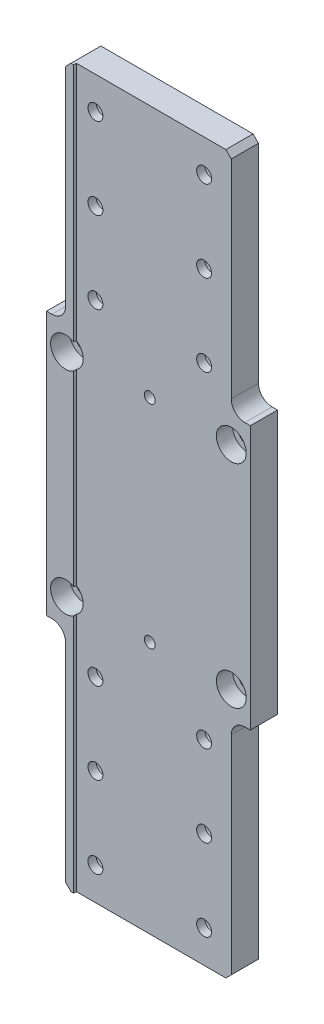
ISO-10303-21;
HEADER;
FILE_DESCRIPTION(('STEP AP214'),'2;1');
FILE_NAME('part.step','',(''),(''),'','','');
FILE_SCHEMA(('AUTOMOTIVE_DESIGN { 1 0 10303 214 1 1 1 1 }'));
ENDSEC;
DATA;
#1=APPLICATION_CONTEXT('core data for automotive mechanical design processes');
#2=APPLICATION_PROTOCOL_DEFINITION('international standard','automotive_design',2000,#1);
#3=PRODUCT_CONTEXT('',#1,'mechanical');
#4=PRODUCT('Part','Part','',(#3));
#5=PRODUCT_RELATED_PRODUCT_CATEGORY('part','',(#4));
#6=PRODUCT_DEFINITION_FORMATION('','',#4);
#7=PRODUCT_DEFINITION_CONTEXT('part definition',#1,'design');
#8=PRODUCT_DEFINITION('design','',#6,#7);
#9=PRODUCT_DEFINITION_SHAPE('','',#8);
#10=(LENGTH_UNIT() NAMED_UNIT(*) SI_UNIT(.MILLI.,.METRE.));
#11=(NAMED_UNIT(*) PLANE_ANGLE_UNIT() SI_UNIT($,.RADIAN.));
#12=(NAMED_UNIT(*) SI_UNIT($,.STERADIAN.) SOLID_ANGLE_UNIT());
#13=UNCERTAINTY_MEASURE_WITH_UNIT(LENGTH_MEASURE(1.E-05),#10,'distance_accuracy_value','');
#14=(GEOMETRIC_REPRESENTATION_CONTEXT(3) GLOBAL_UNCERTAINTY_ASSIGNED_CONTEXT((#13)) GLOBAL_UNIT_ASSIGNED_CONTEXT((#10,
#11,#12)) REPRESENTATION_CONTEXT('',''));
#15=CARTESIAN_POINT('',(0.,0.,0.));
#16=DIRECTION('',(0.,0.,1.));
#17=DIRECTION('',(1.,0.,0.));
#18=AXIS2_PLACEMENT_3D('',#15,#16,#17);
#19=CARTESIAN_POINT('',(-27.,132.,10.));
#20=DIRECTION('',(-1.,0.,0.));
#21=DIRECTION('',(0.,-1.,0.));
#22=AXIS2_PLACEMENT_3D('',#19,#20,#21);
#23=PLANE('',#22);
#24=DIRECTION('',(0.,-1.,0.));
#25=VECTOR('',#24,1.);
#26=CARTESIAN_POINT('',(-27.,132.,10.));
#27=LINE('',#26,#25);
#28=CARTESIAN_POINT('',(-27.,34.3902277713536,10.));
#29=VERTEX_POINT('',#28);
#30=CARTESIAN_POINT('',(-27.,-34.3902277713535,10.));
#31=VERTEX_POINT('',#30);
#32=EDGE_CURVE('E247',#29,#31,#27,.T.);
#33=ORIENTED_EDGE('',*,*,#32,.F.);
#34=DIRECTION('',(0.,0.,1.));
#35=VECTOR('',#34,1.);
#36=CARTESIAN_POINT('',(-27.,34.3902277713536,11.));
#37=LINE('',#36,#35);
#38=CARTESIAN_POINT('',(-27.,34.3902277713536,11.));
#39=VERTEX_POINT('',#38);
#40=EDGE_CURVE('E232',#29,#39,#37,.T.);
#41=ORIENTED_EDGE('',*,*,#40,.T.);
#42=DIRECTION('',(0.,-1.,0.));
#43=VECTOR('',#42,1.);
#44=CARTESIAN_POINT('',(-27.,132.,11.));
#45=LINE('',#44,#43);
#46=CARTESIAN_POINT('',(-27.,-34.3902277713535,11.));
#47=VERTEX_POINT('',#46);
#48=EDGE_CURVE('E245',#39,#47,#45,.T.);
#49=ORIENTED_EDGE('',*,*,#48,.T.);
#50=DIRECTION('',(0.,0.,1.));
#51=VECTOR('',#50,1.);
#52=CARTESIAN_POINT('',(-27.,-34.3902277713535,11.));
#53=LINE('',#52,#51);
#54=EDGE_CURVE('E329',#47,#31,#53,.F.);
#55=ORIENTED_EDGE('',*,*,#54,.T.);
#56=EDGE_LOOP('',(#33,#41,#49,#55));
#57=FACE_BOUND('',#56,.T.);
#58=ADVANCED_FACE('F57',(#57),#23,.F.);
#59=CARTESIAN_POINT('',(-27.,-43.6097722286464,10.));
#60=VERTEX_POINT('',#59);
#61=CARTESIAN_POINT('',(-27.,-132.,10.));
#62=VERTEX_POINT('',#61);
#63=EDGE_CURVE('E258',#60,#62,#27,.T.);
#64=ORIENTED_EDGE('',*,*,#63,.F.);
#65=DIRECTION('',(0.,0.,1.));
#66=VECTOR('',#65,1.);
#67=CARTESIAN_POINT('',(-27.,-43.6097722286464,11.));
#68=LINE('',#67,#66);
#69=CARTESIAN_POINT('',(-27.,-43.6097722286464,11.));
#70=VERTEX_POINT('',#69);
#71=EDGE_CURVE('E334',#60,#70,#68,.T.);
#72=ORIENTED_EDGE('',*,*,#71,.T.);
#73=CARTESIAN_POINT('',(-27.,-132.,11.));
#74=VERTEX_POINT('',#73);
#75=EDGE_CURVE('E256',#70,#74,#45,.T.);
#76=ORIENTED_EDGE('',*,*,#75,.T.);
#77=DIRECTION('',(0.,0.,1.));
#78=VECTOR('',#77,1.);
#79=CARTESIAN_POINT('',(-27.,-132.,10.));
#80=LINE('',#79,#78);
#81=EDGE_CURVE('E267',#62,#74,#80,.T.);
#82=ORIENTED_EDGE('',*,*,#81,.F.);
#83=EDGE_LOOP('',(#64,#72,#76,#82));
#84=FACE_BOUND('',#83,.T.);
#85=ADVANCED_FACE('F504',(#84),#23,.F.);
#86=CARTESIAN_POINT('',(30.,0.,11.));
#87=DIRECTION('',(1.,0.,0.));
#88=DIRECTION('',(0.,1.,0.));
#89=AXIS2_PLACEMENT_3D('',#86,#87,#88);
#90=PLANE('',#89);
#91=DIRECTION('',(0.,-1.,0.));
#92=VECTOR('',#91,1.);
#93=CARTESIAN_POINT('',(30.,0.,10.));
#94=LINE('',#93,#92);
#95=CARTESIAN_POINT('',(30.,-53.5,10.));
#96=VERTEX_POINT('',#95);
#97=CARTESIAN_POINT('',(30.,-130.,10.));
#98=VERTEX_POINT('',#97);
#99=EDGE_CURVE('E266',#96,#98,#94,.T.);
#100=ORIENTED_EDGE('',*,*,#99,.T.);
#101=DIRECTION('',(0.,0.,-1.));
#102=VECTOR('',#101,1.);
#103=CARTESIAN_POINT('',(30.,-130.,11.));
#104=LINE('',#103,#102);
#105=CARTESIAN_POINT('',(30.,-130.,0.));
#106=VERTEX_POINT('',#105);
#107=EDGE_CURVE('E413',#98,#106,#104,.T.);
#108=ORIENTED_EDGE('',*,*,#107,.T.);
#109=DIRECTION('',(0.,-1.,0.));
#110=VECTOR('',#109,1.);
#111=CARTESIAN_POINT('',(30.,0.,0.));
#112=LINE('',#111,#110);
#113=CARTESIAN_POINT('',(30.,-53.5,0.));
#114=VERTEX_POINT('',#113);
#115=EDGE_CURVE('E292',#114,#106,#112,.T.);
#116=ORIENTED_EDGE('',*,*,#115,.F.);
#117=DIRECTION('',(0.,0.,1.));
#118=VECTOR('',#117,1.);
#119=CARTESIAN_POINT('',(30.,-53.5,11.));
#120=LINE('',#119,#118);
#121=EDGE_CURVE('E248',#114,#96,#120,.T.);
#122=ORIENTED_EDGE('',*,*,#121,.T.);
#123=EDGE_LOOP('',(#100,#108,#116,#122));
#124=FACE_BOUND('',#123,.T.);
#125=ADVANCED_FACE('F554',(#124),#90,.T.);
#126=CARTESIAN_POINT('',(30.,130.,0.));
#127=VERTEX_POINT('',#126);
#128=CARTESIAN_POINT('',(30.,53.5,0.));
#129=VERTEX_POINT('',#128);
#130=EDGE_CURVE('E293',#127,#129,#112,.T.);
#131=ORIENTED_EDGE('',*,*,#130,.F.);
#132=DIRECTION('',(0.,0.,1.));
#133=VECTOR('',#132,1.);
#134=CARTESIAN_POINT('',(30.,130.,10.));
#135=LINE('',#134,#133);
#136=CARTESIAN_POINT('',(30.,130.,10.));
#137=VERTEX_POINT('',#136);
#138=EDGE_CURVE('E12',#127,#137,#135,.T.);
#139=ORIENTED_EDGE('',*,*,#138,.T.);
#140=DIRECTION('',(0.,-1.,0.));
#141=VECTOR('',#140,1.);
#142=CARTESIAN_POINT('',(30.,0.,10.));
#143=LINE('',#142,#141);
#144=CARTESIAN_POINT('',(30.,53.5,10.));
#145=VERTEX_POINT('',#144);
#146=EDGE_CURVE('E274',#137,#145,#143,.T.);
#147=ORIENTED_EDGE('',*,*,#146,.T.);
#148=DIRECTION('',(0.,0.,1.));
#149=VECTOR('',#148,1.);
#150=CARTESIAN_POINT('',(30.,53.5,0.));
#151=LINE('',#150,#149);
#152=EDGE_CURVE('E392',#145,#129,#151,.F.);
#153=ORIENTED_EDGE('',*,*,#152,.T.);
#154=EDGE_LOOP('',(#131,#139,#147,#153));
#155=FACE_BOUND('',#154,.T.);
#156=ADVANCED_FACE('F569',(#155),#90,.T.);
#157=CARTESIAN_POINT('',(37.,48.5,11.));
#158=DIRECTION('',(1.,0.,0.));
#159=DIRECTION('',(0.,1.,0.));
#160=AXIS2_PLACEMENT_3D('',#157,#158,#159);
#161=PLANE('',#160);
#162=DIRECTION('',(0.,0.,-1.));
#163=VECTOR('',#162,1.);
#164=CARTESIAN_POINT('',(37.,48.5,11.));
#165=LINE('',#164,#163);
#166=CARTESIAN_POINT('',(37.,48.5,10.));
#167=VERTEX_POINT('',#166);
#168=CARTESIAN_POINT('',(37.,48.5,0.));
#169=VERTEX_POINT('',#168);
#170=EDGE_CURVE('E306',#167,#169,#165,.T.);
#171=ORIENTED_EDGE('',*,*,#170,.F.);
#172=DIRECTION('',(0.,1.,0.));
#173=VECTOR('',#172,1.);
#174=CARTESIAN_POINT('',(37.,132.,10.));
#175=LINE('',#174,#173);
#176=CARTESIAN_POINT('',(37.,-48.5,10.));
#177=VERTEX_POINT('',#176);
#178=EDGE_CURVE('E531',#177,#167,#175,.T.);
#179=ORIENTED_EDGE('',*,*,#178,.F.);
#180=DIRECTION('',(0.,0.,-1.));
#181=VECTOR('',#180,1.);
#182=CARTESIAN_POINT('',(37.,-48.5,11.));
#183=LINE('',#182,#181);
#184=CARTESIAN_POINT('',(37.,-48.5,0.));
#185=VERTEX_POINT('',#184);
#186=EDGE_CURVE('E323',#177,#185,#183,.T.);
#187=ORIENTED_EDGE('',*,*,#186,.T.);
#188=DIRECTION('',(0.,-1.,0.));
#189=VECTOR('',#188,1.);
#190=CARTESIAN_POINT('',(37.,48.5,0.));
#191=LINE('',#190,#189);
#192=EDGE_CURVE('E310',#169,#185,#191,.T.);
#193=ORIENTED_EDGE('',*,*,#192,.F.);
#194=EDGE_LOOP('',(#171,#179,#187,#193));
#195=FACE_BOUND('',#194,.T.);
#196=ADVANCED_FACE('F567',(#195),#161,.T.);
#197=CARTESIAN_POINT('',(-37.,48.5,11.));
#198=DIRECTION('',(0.,1.,0.));
#199=DIRECTION('',(-1.,0.,0.));
#200=AXIS2_PLACEMENT_3D('',#197,#198,#199);
#201=PLANE('',#200);
#202=DIRECTION('',(1.,0.,0.));
#203=VECTOR('',#202,1.);
#204=CARTESIAN_POINT('',(-37.,48.5,0.));
#205=LINE('',#204,#203);
#206=CARTESIAN_POINT('',(35.,48.5,0.));
#207=VERTEX_POINT('',#206);
#208=EDGE_CURVE('E276',#207,#169,#205,.T.);
#209=ORIENTED_EDGE('',*,*,#208,.F.);
#210=DIRECTION('',(0.,0.,1.));
#211=VECTOR('',#210,1.);
#212=CARTESIAN_POINT('',(35.,48.5,10.));
#213=LINE('',#212,#211);
#214=CARTESIAN_POINT('',(35.,48.5,10.));
#215=VERTEX_POINT('',#214);
#216=EDGE_CURVE('E389',#207,#215,#213,.T.);
#217=ORIENTED_EDGE('',*,*,#216,.T.);
#218=DIRECTION('',(1.,0.,0.));
#219=VECTOR('',#218,1.);
#220=CARTESIAN_POINT('',(-37.,48.5,10.));
#221=LINE('',#220,#219);
#222=EDGE_CURVE('E272',#215,#167,#221,.T.);
#223=ORIENTED_EDGE('',*,*,#222,.T.);
#224=ORIENTED_EDGE('',*,*,#170,.T.);
#225=EDGE_LOOP('',(#209,#217,#223,#224));
#226=FACE_BOUND('',#225,.T.);
#227=ADVANCED_FACE('F561',(#226),#201,.T.);
#228=CARTESIAN_POINT('',(-37.,-48.5,11.));
#229=DIRECTION('',(0.,1.,0.));
#230=DIRECTION('',(0.,0.,1.));
#231=AXIS2_PLACEMENT_3D('',#228,#229,#230);
#232=PLANE('',#231);
#233=DIRECTION('',(1.,0.,0.));
#234=VECTOR('',#233,1.);
#235=CARTESIAN_POINT('',(-37.,-48.5,10.));
#236=LINE('',#235,#234);
#237=CARTESIAN_POINT('',(35.,-48.5,10.));
#238=VERTEX_POINT('',#237);
#239=EDGE_CURVE('E285',#238,#177,#236,.T.);
#240=ORIENTED_EDGE('',*,*,#239,.F.);
#241=DIRECTION('',(0.,0.,1.));
#242=VECTOR('',#241,1.);
#243=CARTESIAN_POINT('',(35.,-48.5,11.));
#244=LINE('',#243,#242);
#245=CARTESIAN_POINT('',(35.,-48.5,0.));
#246=VERTEX_POINT('',#245);
#247=EDGE_CURVE('E377',#238,#246,#244,.F.);
#248=ORIENTED_EDGE('',*,*,#247,.T.);
#249=DIRECTION('',(1.,0.,0.));
#250=VECTOR('',#249,1.);
#251=CARTESIAN_POINT('',(-37.,-48.5,0.));
#252=LINE('',#251,#250);
#253=EDGE_CURVE('E313',#246,#185,#252,.T.);
#254=ORIENTED_EDGE('',*,*,#253,.T.);
#255=ORIENTED_EDGE('',*,*,#186,.F.);
#256=EDGE_LOOP('',(#240,#248,#254,#255));
#257=FACE_BOUND('',#256,.T.);
#258=ADVANCED_FACE('F550',(#257),#232,.F.);
#259=CARTESIAN_POINT('',(-30.,0.,11.));
#260=DIRECTION('',(1.,0.,0.));
#261=DIRECTION('',(0.,1.,0.));
#262=AXIS2_PLACEMENT_3D('',#259,#260,#261);
#263=PLANE('',#262);
#264=DIRECTION('',(0.,-1.,0.));
#265=VECTOR('',#264,1.);
#266=CARTESIAN_POINT('',(-30.,0.,0.));
#267=LINE('',#266,#265);
#268=CARTESIAN_POINT('',(-30.,-53.5,0.));
#269=VERTEX_POINT('',#268);
#270=CARTESIAN_POINT('',(-30.,-130.,0.));
#271=VERTEX_POINT('',#270);
#272=EDGE_CURVE('E289',#269,#271,#267,.T.);
#273=ORIENTED_EDGE('',*,*,#272,.T.);
#274=DIRECTION('',(0.,0.,1.));
#275=VECTOR('',#274,1.);
#276=CARTESIAN_POINT('',(-30.,-130.,11.));
#277=LINE('',#276,#275);
#278=CARTESIAN_POINT('',(-30.,-130.,11.));
#279=VERTEX_POINT('',#278);
#280=EDGE_CURVE('E433',#271,#279,#277,.T.);
#281=ORIENTED_EDGE('',*,*,#280,.T.);
#282=DIRECTION('',(0.,-1.,0.));
#283=VECTOR('',#282,1.);
#284=CARTESIAN_POINT('',(-30.,0.,11.));
#285=LINE('',#284,#283);
#286=CARTESIAN_POINT('',(-30.,-53.5,11.));
#287=VERTEX_POINT('',#286);
#288=EDGE_CURVE('E280',#287,#279,#285,.T.);
#289=ORIENTED_EDGE('',*,*,#288,.F.);
#290=DIRECTION('',(0.,0.,1.));
#291=VECTOR('',#290,1.);
#292=CARTESIAN_POINT('',(-30.,-53.5,0.));
#293=LINE('',#292,#291);
#294=EDGE_CURVE('E382',#287,#269,#293,.F.);
#295=ORIENTED_EDGE('',*,*,#294,.T.);
#296=EDGE_LOOP('',(#273,#281,#289,#295));
#297=FACE_BOUND('',#296,.T.);
#298=ADVANCED_FACE('F486',(#297),#263,.F.);
#299=CARTESIAN_POINT('',(0.,-132.,11.));
#300=DIRECTION('',(0.,-1.,0.));
#301=DIRECTION('',(1.,0.,0.));
#302=AXIS2_PLACEMENT_3D('',#299,#300,#301);
#303=PLANE('',#302);
#304=DIRECTION('',(-1.,0.,0.));
#305=VECTOR('',#304,1.);
#306=CARTESIAN_POINT('',(0.,-132.,0.));
#307=LINE('',#306,#305);
#308=CARTESIAN_POINT('',(28.,-132.,0.));
#309=VERTEX_POINT('',#308);
#310=CARTESIAN_POINT('',(-28.,-132.,0.));
#311=VERTEX_POINT('',#310);
#312=EDGE_CURVE('E288',#309,#311,#307,.T.);
#313=ORIENTED_EDGE('',*,*,#312,.F.);
#314=DIRECTION('',(0.,0.,1.));
#315=VECTOR('',#314,1.);
#316=CARTESIAN_POINT('',(28.,-132.,11.));
#317=LINE('',#316,#315);
#318=CARTESIAN_POINT('',(28.,-132.,10.));
#319=VERTEX_POINT('',#318);
#320=EDGE_CURVE('E427',#309,#319,#317,.T.);
#321=ORIENTED_EDGE('',*,*,#320,.T.);
#322=DIRECTION('',(1.,0.,0.));
#323=VECTOR('',#322,1.);
#324=CARTESIAN_POINT('',(-27.,-132.,10.));
#325=LINE('',#324,#323);
#326=EDGE_CURVE('E501',#62,#319,#325,.T.);
#327=ORIENTED_EDGE('',*,*,#326,.F.);
#328=ORIENTED_EDGE('',*,*,#81,.T.);
#329=DIRECTION('',(-1.,0.,0.));
#330=VECTOR('',#329,1.);
#331=CARTESIAN_POINT('',(0.,-132.,11.));
#332=LINE('',#331,#330);
#333=CARTESIAN_POINT('',(-28.,-132.,11.));
#334=VERTEX_POINT('',#333);
#335=EDGE_CURVE('E279',#74,#334,#332,.T.);
#336=ORIENTED_EDGE('',*,*,#335,.T.);
#337=DIRECTION('',(0.,0.,-1.));
#338=VECTOR('',#337,1.);
#339=CARTESIAN_POINT('',(-28.,-132.,0.));
#340=LINE('',#339,#338);
#341=EDGE_CURVE('E424',#334,#311,#340,.T.);
#342=ORIENTED_EDGE('',*,*,#341,.T.);
#343=EDGE_LOOP('',(#313,#321,#327,#328,#336,#342));
#344=FACE_BOUND('',#343,.T.);
#345=ADVANCED_FACE('F497',(#344),#303,.T.);
#346=CARTESIAN_POINT('',(0.,132.,11.));
#347=DIRECTION('',(0.,-1.,0.));
#348=DIRECTION('',(1.,0.,0.));
#349=AXIS2_PLACEMENT_3D('',#346,#347,#348);
#350=PLANE('',#349);
#351=DIRECTION('',(-1.,0.,0.));
#352=VECTOR('',#351,1.);
#353=CARTESIAN_POINT('',(0.,132.,0.));
#354=LINE('',#353,#352);
#355=CARTESIAN_POINT('',(28.,132.,0.));
#356=VERTEX_POINT('',#355);
#357=CARTESIAN_POINT('',(-28.,132.,0.));
#358=VERTEX_POINT('',#357);
#359=EDGE_CURVE('E295',#356,#358,#354,.T.);
#360=ORIENTED_EDGE('',*,*,#359,.T.);
#361=DIRECTION('',(0.,0.,1.));
#362=VECTOR('',#361,1.);
#363=CARTESIAN_POINT('',(-28.,132.,11.));
#364=LINE('',#363,#362);
#365=CARTESIAN_POINT('',(-28.,132.,11.));
#366=VERTEX_POINT('',#365);
#367=EDGE_CURVE('E65',#358,#366,#364,.T.);
#368=ORIENTED_EDGE('',*,*,#367,.T.);
#369=DIRECTION('',(-1.,0.,0.));
#370=VECTOR('',#369,1.);
#371=CARTESIAN_POINT('',(0.,132.,11.));
#372=LINE('',#371,#370);
#373=CARTESIAN_POINT('',(-27.,132.,11.));
#374=VERTEX_POINT('',#373);
#375=EDGE_CURVE('E283',#374,#366,#372,.T.);
#376=ORIENTED_EDGE('',*,*,#375,.F.);
#377=DIRECTION('',(0.,0.,1.));
#378=VECTOR('',#377,1.);
#379=CARTESIAN_POINT('',(-27.,132.,10.));
#380=LINE('',#379,#378);
#381=CARTESIAN_POINT('',(-27.,132.,10.));
#382=VERTEX_POINT('',#381);
#383=EDGE_CURVE('E264',#382,#374,#380,.T.);
#384=ORIENTED_EDGE('',*,*,#383,.F.);
#385=DIRECTION('',(-1.,0.,0.));
#386=VECTOR('',#385,1.);
#387=CARTESIAN_POINT('',(-27.,132.,10.));
#388=LINE('',#387,#386);
#389=CARTESIAN_POINT('',(28.,132.,10.));
#390=VERTEX_POINT('',#389);
#391=EDGE_CURVE('E262',#390,#382,#388,.T.);
#392=ORIENTED_EDGE('',*,*,#391,.F.);
#393=DIRECTION('',(0.,0.,-1.));
#394=VECTOR('',#393,1.);
#395=CARTESIAN_POINT('',(28.,132.,0.));
#396=LINE('',#395,#394);
#397=EDGE_CURVE('E441',#390,#356,#396,.T.);
#398=ORIENTED_EDGE('',*,*,#397,.T.);
#399=EDGE_LOOP('',(#360,#368,#376,#384,#392,#398));
#400=FACE_BOUND('',#399,.T.);
#401=ADVANCED_FACE('F446',(#400),#350,.F.);
#402=CARTESIAN_POINT('',(-30.,130.,11.));
#403=VERTEX_POINT('',#402);
#404=CARTESIAN_POINT('',(-30.,53.5,11.));
#405=VERTEX_POINT('',#404);
#406=EDGE_CURVE('E277',#403,#405,#285,.T.);
#407=ORIENTED_EDGE('',*,*,#406,.F.);
#408=DIRECTION('',(0.,0.,-1.));
#409=VECTOR('',#408,1.);
#410=CARTESIAN_POINT('',(-30.,130.,11.));
#411=LINE('',#410,#409);
#412=CARTESIAN_POINT('',(-30.,130.,0.));
#413=VERTEX_POINT('',#412);
#414=EDGE_CURVE('E438',#403,#413,#411,.T.);
#415=ORIENTED_EDGE('',*,*,#414,.T.);
#416=CARTESIAN_POINT('',(-30.,53.5,0.));
#417=VERTEX_POINT('',#416);
#418=EDGE_CURVE('E286',#413,#417,#267,.T.);
#419=ORIENTED_EDGE('',*,*,#418,.T.);
#420=DIRECTION('',(0.,0.,1.));
#421=VECTOR('',#420,1.);
#422=CARTESIAN_POINT('',(-30.,53.5,11.));
#423=LINE('',#422,#421);
#424=EDGE_CURVE('E384',#417,#405,#423,.T.);
#425=ORIENTED_EDGE('',*,*,#424,.T.);
#426=EDGE_LOOP('',(#407,#415,#419,#425));
#427=FACE_BOUND('',#426,.T.);
#428=ADVANCED_FACE('F459',(#427),#263,.F.);
#429=CARTESIAN_POINT('',(0.,0.,0.));
#430=DIRECTION('',(0.,0.,1.));
#431=DIRECTION('',(1.,0.,0.));
#432=AXIS2_PLACEMENT_3D('',#429,#430,#431);
#433=PLANE('',#432);
#434=CARTESIAN_POINT('',(0.,39.,0.));
#435=DIRECTION('',(0.,0.,-1.));
#436=DIRECTION('',(-1.,0.,0.));
#437=AXIS2_PLACEMENT_3D('',#434,#435,#436);
#438=CIRCLE('',#437,1.99999999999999);
#439=CARTESIAN_POINT('',(-2.00000000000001,39.,0.));
#440=VERTEX_POINT('',#439);
#441=EDGE_CURVE('E374',#440,#440,#438,.T.);
#442=ORIENTED_EDGE('',*,*,#441,.F.);
#443=EDGE_LOOP('',(#442));
#444=FACE_BOUND('',#443,.T.);
#445=CARTESIAN_POINT('',(0.,-39.,0.));
#446=DIRECTION('',(0.,0.,-1.));
#447=DIRECTION('',(-1.,0.,0.));
#448=AXIS2_PLACEMENT_3D('',#445,#446,#447);
#449=CIRCLE('',#448,1.99999999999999);
#450=CARTESIAN_POINT('',(-2.00000000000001,-39.,0.));
#451=VERTEX_POINT('',#450);
#452=EDGE_CURVE('E373',#451,#451,#449,.T.);
#453=ORIENTED_EDGE('',*,*,#452,.F.);
#454=EDGE_LOOP('',(#453));
#455=FACE_BOUND('',#454,.T.);
#456=CARTESIAN_POINT('',(20.,-90.,0.));
#457=DIRECTION('',(0.,0.,-1.));
#458=DIRECTION('',(-1.,0.,0.));
#459=AXIS2_PLACEMENT_3D('',#456,#457,#458);
#460=CIRCLE('',#459,4.75);
#461=CARTESIAN_POINT('',(15.25,-90.,0.));
#462=VERTEX_POINT('',#461);
#463=EDGE_CURVE('E648',#462,#462,#460,.T.);
#464=ORIENTED_EDGE('',*,*,#463,.F.);
#465=EDGE_LOOP('',(#464));
#466=FACE_BOUND('',#465,.T.);
#467=CARTESIAN_POINT('',(-20.,-90.,0.));
#468=DIRECTION('',(0.,0.,-1.));
#469=DIRECTION('',(-1.,0.,0.));
#470=AXIS2_PLACEMENT_3D('',#467,#468,#469);
#471=CIRCLE('',#470,4.75);
#472=CARTESIAN_POINT('',(-24.75,-90.,0.));
#473=VERTEX_POINT('',#472);
#474=EDGE_CURVE('E652',#473,#473,#471,.T.);
#475=ORIENTED_EDGE('',*,*,#474,.F.);
#476=EDGE_LOOP('',(#475));
#477=FACE_BOUND('',#476,.T.);
#478=CARTESIAN_POINT('',(20.,-120.,0.));
#479=DIRECTION('',(0.,0.,-1.));
#480=DIRECTION('',(-1.,0.,0.));
#481=AXIS2_PLACEMENT_3D('',#478,#479,#480);
#482=CIRCLE('',#481,4.75);
#483=CARTESIAN_POINT('',(15.25,-120.,0.));
#484=VERTEX_POINT('',#483);
#485=EDGE_CURVE('E656',#484,#484,#482,.T.);
#486=ORIENTED_EDGE('',*,*,#485,.F.);
#487=EDGE_LOOP('',(#486));
#488=FACE_BOUND('',#487,.T.);
#489=CARTESIAN_POINT('',(-20.,-120.,0.));
#490=DIRECTION('',(0.,0.,-1.));
#491=DIRECTION('',(-1.,0.,0.));
#492=AXIS2_PLACEMENT_3D('',#489,#490,#491);
#493=CIRCLE('',#492,4.75);
#494=CARTESIAN_POINT('',(-24.75,-120.,0.));
#495=VERTEX_POINT('',#494);
#496=EDGE_CURVE('E660',#495,#495,#493,.T.);
#497=ORIENTED_EDGE('',*,*,#496,.F.);
#498=EDGE_LOOP('',(#497));
#499=FACE_BOUND('',#498,.T.);
#500=CARTESIAN_POINT('',(-20.,-60.,0.));
#501=DIRECTION('',(0.,0.,-1.));
#502=DIRECTION('',(-1.,0.,0.));
#503=AXIS2_PLACEMENT_3D('',#500,#501,#502);
#504=CIRCLE('',#503,4.75);
#505=CARTESIAN_POINT('',(-24.75,-60.,0.));
#506=VERTEX_POINT('',#505);
#507=EDGE_CURVE('E664',#506,#506,#504,.T.);
#508=ORIENTED_EDGE('',*,*,#507,.F.);
#509=EDGE_LOOP('',(#508));
#510=FACE_BOUND('',#509,.T.);
#511=CARTESIAN_POINT('',(20.,-60.,0.));
#512=DIRECTION('',(0.,0.,-1.));
#513=DIRECTION('',(-1.,0.,0.));
#514=AXIS2_PLACEMENT_3D('',#511,#512,#513);
#515=CIRCLE('',#514,4.75);
#516=CARTESIAN_POINT('',(15.25,-60.,0.));
#517=VERTEX_POINT('',#516);
#518=EDGE_CURVE('E668',#517,#517,#515,.T.);
#519=ORIENTED_EDGE('',*,*,#518,.F.);
#520=EDGE_LOOP('',(#519));
#521=FACE_BOUND('',#520,.T.);
#522=CARTESIAN_POINT('',(20.,120.,0.));
#523=DIRECTION('',(0.,0.,-1.));
#524=DIRECTION('',(-1.,0.,0.));
#525=AXIS2_PLACEMENT_3D('',#522,#523,#524);
#526=CIRCLE('',#525,4.75);
#527=CARTESIAN_POINT('',(15.25,120.,0.));
#528=VERTEX_POINT('',#527);
#529=EDGE_CURVE('E672',#528,#528,#526,.T.);
#530=ORIENTED_EDGE('',*,*,#529,.F.);
#531=EDGE_LOOP('',(#530));
#532=FACE_BOUND('',#531,.T.);
#533=CARTESIAN_POINT('',(20.,90.,0.));
#534=DIRECTION('',(0.,0.,-1.));
#535=DIRECTION('',(-1.,0.,0.));
#536=AXIS2_PLACEMENT_3D('',#533,#534,#535);
#537=CIRCLE('',#536,4.75);
#538=CARTESIAN_POINT('',(15.25,90.,0.));
#539=VERTEX_POINT('',#538);
#540=EDGE_CURVE('E368',#539,#539,#537,.T.);
#541=ORIENTED_EDGE('',*,*,#540,.F.);
#542=EDGE_LOOP('',(#541));
#543=FACE_BOUND('',#542,.T.);
#544=CARTESIAN_POINT('',(-20.,90.,0.));
#545=DIRECTION('',(0.,0.,-1.));
#546=DIRECTION('',(-1.,0.,0.));
#547=AXIS2_PLACEMENT_3D('',#544,#545,#546);
#548=CIRCLE('',#547,4.75);
#549=CARTESIAN_POINT('',(-24.75,90.,0.));
#550=VERTEX_POINT('',#549);
#551=EDGE_CURVE('E363',#550,#550,#548,.T.);
#552=ORIENTED_EDGE('',*,*,#551,.F.);
#553=EDGE_LOOP('',(#552));
#554=FACE_BOUND('',#553,.T.);
#555=CARTESIAN_POINT('',(20.,60.,0.));
#556=DIRECTION('',(0.,0.,-1.));
#557=DIRECTION('',(-1.,0.,0.));
#558=AXIS2_PLACEMENT_3D('',#555,#556,#557);
#559=CIRCLE('',#558,4.75);
#560=CARTESIAN_POINT('',(15.25,60.,0.));
#561=VERTEX_POINT('',#560);
#562=EDGE_CURVE('E358',#561,#561,#559,.T.);
#563=ORIENTED_EDGE('',*,*,#562,.F.);
#564=EDGE_LOOP('',(#563));
#565=FACE_BOUND('',#564,.T.);
#566=CARTESIAN_POINT('',(-20.,60.,0.));
#567=DIRECTION('',(0.,0.,-1.));
#568=DIRECTION('',(-1.,0.,0.));
#569=AXIS2_PLACEMENT_3D('',#566,#567,#568);
#570=CIRCLE('',#569,4.75);
#571=CARTESIAN_POINT('',(-24.75,60.,0.));
#572=VERTEX_POINT('',#571);
#573=EDGE_CURVE('E353',#572,#572,#570,.T.);
#574=ORIENTED_EDGE('',*,*,#573,.F.);
#575=EDGE_LOOP('',(#574));
#576=FACE_BOUND('',#575,.T.);
#577=CARTESIAN_POINT('',(-20.,120.,0.));
#578=DIRECTION('',(0.,0.,-1.));
#579=DIRECTION('',(-1.,0.,0.));
#580=AXIS2_PLACEMENT_3D('',#577,#578,#579);
#581=CIRCLE('',#580,4.75);
#582=CARTESIAN_POINT('',(-24.75,120.,0.));
#583=VERTEX_POINT('',#582);
#584=EDGE_CURVE('E348',#583,#583,#581,.T.);
#585=ORIENTED_EDGE('',*,*,#584,.F.);
#586=EDGE_LOOP('',(#585));
#587=FACE_BOUND('',#586,.T.);
#588=CARTESIAN_POINT('',(-30.,39.,0.));
#589=DIRECTION('',(0.,0.,1.));
#590=DIRECTION('',(1.,0.,0.));
#591=AXIS2_PLACEMENT_3D('',#588,#589,#590);
#592=CIRCLE('',#591,3.3);
#593=CARTESIAN_POINT('',(-26.7,39.,0.));
#594=VERTEX_POINT('',#593);
#595=EDGE_CURVE('E691',#594,#594,#592,.T.);
#596=ORIENTED_EDGE('',*,*,#595,.T.);
#597=EDGE_LOOP('',(#596));
#598=FACE_BOUND('',#597,.T.);
#599=CARTESIAN_POINT('',(30.,39.,0.));
#600=DIRECTION('',(0.,0.,1.));
#601=DIRECTION('',(1.,0.,0.));
#602=AXIS2_PLACEMENT_3D('',#599,#600,#601);
#603=CIRCLE('',#602,3.3);
#604=CARTESIAN_POINT('',(33.3,39.,0.));
#605=VERTEX_POINT('',#604);
#606=EDGE_CURVE('E340',#605,#605,#603,.T.);
#607=ORIENTED_EDGE('',*,*,#606,.T.);
#608=EDGE_LOOP('',(#607));
#609=FACE_BOUND('',#608,.T.);
#610=CARTESIAN_POINT('',(-30.,-39.,0.));
#611=DIRECTION('',(0.,0.,1.));
#612=DIRECTION('',(1.,0.,0.));
#613=AXIS2_PLACEMENT_3D('',#610,#611,#612);
#614=CIRCLE('',#613,3.3);
#615=CARTESIAN_POINT('',(-26.7,-39.,0.));
#616=VERTEX_POINT('',#615);
#617=EDGE_CURVE('E514',#616,#616,#614,.T.);
#618=ORIENTED_EDGE('',*,*,#617,.T.);
#619=EDGE_LOOP('',(#618));
#620=FACE_BOUND('',#619,.T.);
#621=CARTESIAN_POINT('',(30.,-39.,0.));
#622=DIRECTION('',(0.,0.,1.));
#623=DIRECTION('',(1.,0.,0.));
#624=AXIS2_PLACEMENT_3D('',#621,#622,#623);
#625=CIRCLE('',#624,3.3);
#626=CARTESIAN_POINT('',(33.3,-39.,0.));
#627=VERTEX_POINT('',#626);
#628=EDGE_CURVE('E332',#627,#627,#625,.T.);
#629=ORIENTED_EDGE('',*,*,#628,.T.);
#630=EDGE_LOOP('',(#629));
#631=FACE_BOUND('',#630,.T.);
#632=ORIENTED_EDGE('',*,*,#115,.T.);
#633=DIRECTION('',(0.707106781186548,0.707106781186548,0.));
#634=VECTOR('',#633,1.);
#635=CARTESIAN_POINT('',(30.,-130.,0.));
#636=LINE('',#635,#634);
#637=EDGE_CURVE('E422',#106,#309,#636,.F.);
#638=ORIENTED_EDGE('',*,*,#637,.T.);
#639=ORIENTED_EDGE('',*,*,#312,.T.);
#640=DIRECTION('',(-0.707106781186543,0.707106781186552,0.));
#641=VECTOR('',#640,1.);
#642=CARTESIAN_POINT('',(-28.,-132.,0.));
#643=LINE('',#642,#641);
#644=EDGE_CURVE('E420',#311,#271,#643,.T.);
#645=ORIENTED_EDGE('',*,*,#644,.T.);
#646=ORIENTED_EDGE('',*,*,#272,.F.);
#647=CARTESIAN_POINT('',(-35.,-53.5,0.));
#648=DIRECTION('',(0.,0.,1.));
#649=DIRECTION('',(1.,0.,0.));
#650=AXIS2_PLACEMENT_3D('',#647,#648,#649);
#651=CIRCLE('',#650,5.);
#652=CARTESIAN_POINT('',(-35.,-48.5,0.));
#653=VERTEX_POINT('',#652);
#654=EDGE_CURVE('E401',#269,#653,#651,.T.);
#655=ORIENTED_EDGE('',*,*,#654,.T.);
#656=CARTESIAN_POINT('',(-37.,-48.5,0.));
#657=VERTEX_POINT('',#656);
#658=EDGE_CURVE('E314',#657,#653,#252,.T.);
#659=ORIENTED_EDGE('',*,*,#658,.F.);
#660=DIRECTION('',(0.,-1.,0.));
#661=VECTOR('',#660,1.);
#662=CARTESIAN_POINT('',(-37.,48.5,0.));
#663=LINE('',#662,#661);
#664=CARTESIAN_POINT('',(-37.,48.5,0.));
#665=VERTEX_POINT('',#664);
#666=EDGE_CURVE('E301',#665,#657,#663,.T.);
#667=ORIENTED_EDGE('',*,*,#666,.F.);
#668=CARTESIAN_POINT('',(-35.,48.5,0.));
#669=VERTEX_POINT('',#668);
#670=EDGE_CURVE('E307',#665,#669,#205,.T.);
#671=ORIENTED_EDGE('',*,*,#670,.T.);
#672=CARTESIAN_POINT('',(-35.,53.5,0.));
#673=DIRECTION('',(0.,0.,1.));
#674=DIRECTION('',(1.,0.,0.));
#675=AXIS2_PLACEMENT_3D('',#672,#673,#674);
#676=CIRCLE('',#675,5.);
#677=EDGE_CURVE('E405',#669,#417,#676,.T.);
#678=ORIENTED_EDGE('',*,*,#677,.T.);
#679=ORIENTED_EDGE('',*,*,#418,.F.);
#680=DIRECTION('',(-0.707106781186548,-0.707106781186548,0.));
#681=VECTOR('',#680,1.);
#682=CARTESIAN_POINT('',(-30.,130.,0.));
#683=LINE('',#682,#681);
#684=EDGE_CURVE('E418',#413,#358,#683,.F.);
#685=ORIENTED_EDGE('',*,*,#684,.T.);
#686=ORIENTED_EDGE('',*,*,#359,.F.);
#687=DIRECTION('',(0.707106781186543,-0.707106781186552,0.));
#688=VECTOR('',#687,1.);
#689=CARTESIAN_POINT('',(28.,132.,0.));
#690=LINE('',#689,#688);
#691=EDGE_CURVE('E416',#356,#127,#690,.T.);
#692=ORIENTED_EDGE('',*,*,#691,.T.);
#693=ORIENTED_EDGE('',*,*,#130,.T.);
#694=CARTESIAN_POINT('',(35.,53.5,0.));
#695=DIRECTION('',(0.,0.,1.));
#696=DIRECTION('',(1.,0.,0.));
#697=AXIS2_PLACEMENT_3D('',#694,#695,#696);
#698=CIRCLE('',#697,5.);
#699=EDGE_CURVE('E411',#129,#207,#698,.T.);
#700=ORIENTED_EDGE('',*,*,#699,.T.);
#701=ORIENTED_EDGE('',*,*,#208,.T.);
#702=ORIENTED_EDGE('',*,*,#192,.T.);
#703=ORIENTED_EDGE('',*,*,#253,.F.);
#704=CARTESIAN_POINT('',(35.,-53.5,0.));
#705=DIRECTION('',(0.,0.,1.));
#706=DIRECTION('',(1.,0.,0.));
#707=AXIS2_PLACEMENT_3D('',#704,#705,#706);
#708=CIRCLE('',#707,5.);
#709=EDGE_CURVE('E397',#246,#114,#708,.T.);
#710=ORIENTED_EDGE('',*,*,#709,.T.);
#711=EDGE_LOOP('',(#632,#638,#639,#645,#646,#655,#659,#667,#671,#678,#679,#685,#686,#692,#693,
#700,#701,#702,#703,#710));
#712=FACE_BOUND('',#711,.T.);
#713=ADVANCED_FACE('F452',(#444,#455,#466,#477,#488,#499,#510,#521,#532,#543,#554,#565,#576,
#587,#598,#609,#620,#631,#712),#433,.F.);
#714=CARTESIAN_POINT('',(0.,0.,11.));
#715=DIRECTION('',(0.,0.,1.));
#716=DIRECTION('',(1.,0.,0.));
#717=AXIS2_PLACEMENT_3D('',#714,#715,#716);
#718=PLANE('',#717);
#719=ORIENTED_EDGE('',*,*,#288,.T.);
#720=DIRECTION('',(0.707106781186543,-0.707106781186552,0.));
#721=VECTOR('',#720,1.);
#722=CARTESIAN_POINT('',(-80.0000000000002,-79.9999999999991,11.));
#723=LINE('',#722,#721);
#724=EDGE_CURVE('E436',#279,#334,#723,.T.);
#725=ORIENTED_EDGE('',*,*,#724,.T.);
#726=ORIENTED_EDGE('',*,*,#335,.F.);
#727=ORIENTED_EDGE('',*,*,#75,.F.);
#728=CARTESIAN_POINT('',(-30.,-39.,11.));
#729=DIRECTION('',(0.,0.,1.));
#730=DIRECTION('',(1.,0.,0.));
#731=AXIS2_PLACEMENT_3D('',#728,#729,#730);
#732=CIRCLE('',#731,5.5);
#733=EDGE_CURVE('E254',#47,#70,#732,.T.);
#734=ORIENTED_EDGE('',*,*,#733,.F.);
#735=ORIENTED_EDGE('',*,*,#48,.F.);
#736=CARTESIAN_POINT('',(-30.,39.,11.));
#737=DIRECTION('',(0.,0.,1.));
#738=DIRECTION('',(1.,0.,0.));
#739=AXIS2_PLACEMENT_3D('',#736,#737,#738);
#740=CIRCLE('',#739,5.5);
#741=CARTESIAN_POINT('',(-27.,43.6097722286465,11.));
#742=VERTEX_POINT('',#741);
#743=EDGE_CURVE('E229',#742,#39,#740,.T.);
#744=ORIENTED_EDGE('',*,*,#743,.F.);
#745=EDGE_CURVE('E255',#374,#742,#45,.T.);
#746=ORIENTED_EDGE('',*,*,#745,.F.);
#747=ORIENTED_EDGE('',*,*,#375,.T.);
#748=DIRECTION('',(0.707106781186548,0.707106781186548,0.));
#749=VECTOR('',#748,1.);
#750=CARTESIAN_POINT('',(-80.,80.,11.));
#751=LINE('',#750,#749);
#752=EDGE_CURVE('E72',#366,#403,#751,.F.);
#753=ORIENTED_EDGE('',*,*,#752,.T.);
#754=ORIENTED_EDGE('',*,*,#406,.T.);
#755=CARTESIAN_POINT('',(-35.,53.5,11.));
#756=DIRECTION('',(0.,0.,1.));
#757=DIRECTION('',(1.,0.,0.));
#758=AXIS2_PLACEMENT_3D('',#755,#756,#757);
#759=CIRCLE('',#758,5.);
#760=CARTESIAN_POINT('',(-35.,48.5,11.));
#761=VERTEX_POINT('',#760);
#762=EDGE_CURVE('E403',#405,#761,#759,.F.);
#763=ORIENTED_EDGE('',*,*,#762,.T.);
#764=DIRECTION('',(1.,0.,0.));
#765=VECTOR('',#764,1.);
#766=CARTESIAN_POINT('',(-37.,48.5,11.));
#767=LINE('',#766,#765);
#768=CARTESIAN_POINT('',(-37.,48.5,11.));
#769=VERTEX_POINT('',#768);
#770=EDGE_CURVE('E297',#769,#761,#767,.T.);
#771=ORIENTED_EDGE('',*,*,#770,.F.);
#772=DIRECTION('',(0.,-1.,0.));
#773=VECTOR('',#772,1.);
#774=CARTESIAN_POINT('',(-37.,48.5,11.));
#775=LINE('',#774,#773);
#776=CARTESIAN_POINT('',(-37.,-48.5,11.));
#777=VERTEX_POINT('',#776);
#778=EDGE_CURVE('E304',#769,#777,#775,.T.);
#779=ORIENTED_EDGE('',*,*,#778,.T.);
#780=DIRECTION('',(1.,0.,0.));
#781=VECTOR('',#780,1.);
#782=CARTESIAN_POINT('',(-37.,-48.5,11.));
#783=LINE('',#782,#781);
#784=CARTESIAN_POINT('',(-35.,-48.5,11.));
#785=VERTEX_POINT('',#784);
#786=EDGE_CURVE('E300',#777,#785,#783,.T.);
#787=ORIENTED_EDGE('',*,*,#786,.T.);
#788=CARTESIAN_POINT('',(-35.,-53.5,11.));
#789=DIRECTION('',(0.,0.,1.));
#790=DIRECTION('',(1.,0.,0.));
#791=AXIS2_PLACEMENT_3D('',#788,#789,#790);
#792=CIRCLE('',#791,5.);
#793=EDGE_CURVE('E399',#785,#287,#792,.F.);
#794=ORIENTED_EDGE('',*,*,#793,.T.);
#795=EDGE_LOOP('',(#719,#725,#726,#727,#734,#735,#744,#746,#747,#753,#754,#763,#771,#779,#787,#794));
#796=FACE_BOUND('',#795,.T.);
#797=ADVANCED_FACE('F252',(#796),#718,.T.);
#798=ORIENTED_EDGE('',*,*,#770,.T.);
#799=DIRECTION('',(0.,0.,1.));
#800=VECTOR('',#799,1.);
#801=CARTESIAN_POINT('',(-35.,48.5,11.));
#802=LINE('',#801,#800);
#803=EDGE_CURVE('E387',#761,#669,#802,.F.);
#804=ORIENTED_EDGE('',*,*,#803,.T.);
#805=ORIENTED_EDGE('',*,*,#670,.F.);
#806=DIRECTION('',(0.,0.,-1.));
#807=VECTOR('',#806,1.);
#808=CARTESIAN_POINT('',(-37.,48.5,11.));
#809=LINE('',#808,#807);
#810=EDGE_CURVE('E318',#769,#665,#809,.T.);
#811=ORIENTED_EDGE('',*,*,#810,.F.);
#812=EDGE_LOOP('',(#798,#804,#805,#811));
#813=FACE_BOUND('',#812,.T.);
#814=ADVANCED_FACE('F469',(#813),#201,.T.);
#815=CARTESIAN_POINT('',(-37.,48.5,11.));
#816=DIRECTION('',(1.,0.,0.));
#817=DIRECTION('',(0.,1.,0.));
#818=AXIS2_PLACEMENT_3D('',#815,#816,#817);
#819=PLANE('',#818);
#820=ORIENTED_EDGE('',*,*,#666,.T.);
#821=DIRECTION('',(0.,0.,-1.));
#822=VECTOR('',#821,1.);
#823=CARTESIAN_POINT('',(-37.,-48.5,11.));
#824=LINE('',#823,#822);
#825=EDGE_CURVE('E320',#777,#657,#824,.T.);
#826=ORIENTED_EDGE('',*,*,#825,.F.);
#827=ORIENTED_EDGE('',*,*,#778,.F.);
#828=ORIENTED_EDGE('',*,*,#810,.T.);
#829=EDGE_LOOP('',(#820,#826,#827,#828));
#830=FACE_BOUND('',#829,.T.);
#831=ADVANCED_FACE('F474',(#830),#819,.F.);
#832=ORIENTED_EDGE('',*,*,#658,.T.);
#833=DIRECTION('',(0.,0.,1.));
#834=VECTOR('',#833,1.);
#835=CARTESIAN_POINT('',(-35.,-48.5,11.));
#836=LINE('',#835,#834);
#837=EDGE_CURVE('E379',#653,#785,#836,.T.);
#838=ORIENTED_EDGE('',*,*,#837,.T.);
#839=ORIENTED_EDGE('',*,*,#786,.F.);
#840=ORIENTED_EDGE('',*,*,#825,.T.);
#841=EDGE_LOOP('',(#832,#838,#839,#840));
#842=FACE_BOUND('',#841,.T.);
#843=ADVANCED_FACE('F478',(#842),#232,.F.);
#844=ORIENTED_EDGE('',*,*,#745,.T.);
#845=DIRECTION('',(0.,0.,1.));
#846=VECTOR('',#845,1.);
#847=CARTESIAN_POINT('',(-27.,43.6097722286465,11.));
#848=LINE('',#847,#846);
#849=CARTESIAN_POINT('',(-27.,43.6097722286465,10.));
#850=VERTEX_POINT('',#849);
#851=EDGE_CURVE('E235',#742,#850,#848,.F.);
#852=ORIENTED_EDGE('',*,*,#851,.T.);
#853=EDGE_CURVE('E528',#382,#850,#27,.T.);
#854=ORIENTED_EDGE('',*,*,#853,.F.);
#855=ORIENTED_EDGE('',*,*,#383,.T.);
#856=EDGE_LOOP('',(#844,#852,#854,#855));
#857=FACE_BOUND('',#856,.T.);
#858=ADVANCED_FACE('F539',(#857),#23,.F.);
#859=CARTESIAN_POINT('',(0.,0.,10.));
#860=DIRECTION('',(0.,0.,1.));
#861=DIRECTION('',(1.,0.,0.));
#862=AXIS2_PLACEMENT_3D('',#859,#860,#861);
#863=PLANE('',#862);
#864=CARTESIAN_POINT('',(0.,39.,10.));
#865=DIRECTION('',(0.,0.,1.));
#866=DIRECTION('',(1.,0.,0.));
#867=AXIS2_PLACEMENT_3D('',#864,#865,#866);
#868=CIRCLE('',#867,1.99999999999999);
#869=CARTESIAN_POINT('',(1.99999999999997,39.,10.));
#870=VERTEX_POINT('',#869);
#871=EDGE_CURVE('E370',#870,#870,#868,.T.);
#872=ORIENTED_EDGE('',*,*,#871,.F.);
#873=EDGE_LOOP('',(#872));
#874=FACE_BOUND('',#873,.T.);
#875=CARTESIAN_POINT('',(0.,-39.,10.));
#876=DIRECTION('',(0.,0.,1.));
#877=DIRECTION('',(1.,0.,0.));
#878=AXIS2_PLACEMENT_3D('',#875,#876,#877);
#879=CIRCLE('',#878,1.99999999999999);
#880=CARTESIAN_POINT('',(1.99999999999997,-39.,10.));
#881=VERTEX_POINT('',#880);
#882=EDGE_CURVE('E908',#881,#881,#879,.T.);
#883=ORIENTED_EDGE('',*,*,#882,.F.);
#884=EDGE_LOOP('',(#883));
#885=FACE_BOUND('',#884,.T.);
#886=CARTESIAN_POINT('',(20.,-90.,10.));
#887=DIRECTION('',(0.,0.,1.));
#888=DIRECTION('',(1.,0.,0.));
#889=AXIS2_PLACEMENT_3D('',#886,#887,#888);
#890=CIRCLE('',#889,2.75);
#891=CARTESIAN_POINT('',(22.75,-90.,10.));
#892=VERTEX_POINT('',#891);
#893=EDGE_CURVE('E912',#892,#892,#890,.T.);
#894=ORIENTED_EDGE('',*,*,#893,.F.);
#895=EDGE_LOOP('',(#894));
#896=FACE_BOUND('',#895,.T.);
#897=CARTESIAN_POINT('',(-20.,-90.,10.));
#898=DIRECTION('',(0.,0.,1.));
#899=DIRECTION('',(1.,0.,0.));
#900=AXIS2_PLACEMENT_3D('',#897,#898,#899);
#901=CIRCLE('',#900,2.75);
#902=CARTESIAN_POINT('',(-17.25,-90.,10.));
#903=VERTEX_POINT('',#902);
#904=EDGE_CURVE('E922',#903,#903,#901,.T.);
#905=ORIENTED_EDGE('',*,*,#904,.F.);
#906=EDGE_LOOP('',(#905));
#907=FACE_BOUND('',#906,.T.);
#908=CARTESIAN_POINT('',(20.,-120.,10.));
#909=DIRECTION('',(0.,0.,1.));
#910=DIRECTION('',(1.,0.,0.));
#911=AXIS2_PLACEMENT_3D('',#908,#909,#910);
#912=CIRCLE('',#911,2.75);
#913=CARTESIAN_POINT('',(22.75,-120.,10.));
#914=VERTEX_POINT('',#913);
#915=EDGE_CURVE('E932',#914,#914,#912,.T.);
#916=ORIENTED_EDGE('',*,*,#915,.F.);
#917=EDGE_LOOP('',(#916));
#918=FACE_BOUND('',#917,.T.);
#919=CARTESIAN_POINT('',(-20.,-120.,10.));
#920=DIRECTION('',(0.,0.,1.));
#921=DIRECTION('',(1.,0.,0.));
#922=AXIS2_PLACEMENT_3D('',#919,#920,#921);
#923=CIRCLE('',#922,2.75);
#924=CARTESIAN_POINT('',(-17.25,-120.,10.));
#925=VERTEX_POINT('',#924);
#926=EDGE_CURVE('E942',#925,#925,#923,.T.);
#927=ORIENTED_EDGE('',*,*,#926,.F.);
#928=EDGE_LOOP('',(#927));
#929=FACE_BOUND('',#928,.T.);
#930=CARTESIAN_POINT('',(-20.,-60.,10.));
#931=DIRECTION('',(0.,0.,1.));
#932=DIRECTION('',(1.,0.,0.));
#933=AXIS2_PLACEMENT_3D('',#930,#931,#932);
#934=CIRCLE('',#933,2.75);
#935=CARTESIAN_POINT('',(-17.25,-60.,10.));
#936=VERTEX_POINT('',#935);
#937=EDGE_CURVE('E952',#936,#936,#934,.T.);
#938=ORIENTED_EDGE('',*,*,#937,.F.);
#939=EDGE_LOOP('',(#938));
#940=FACE_BOUND('',#939,.T.);
#941=CARTESIAN_POINT('',(20.,-60.,10.));
#942=DIRECTION('',(0.,0.,1.));
#943=DIRECTION('',(1.,0.,0.));
#944=AXIS2_PLACEMENT_3D('',#941,#942,#943);
#945=CIRCLE('',#944,2.75);
#946=CARTESIAN_POINT('',(22.75,-60.,10.));
#947=VERTEX_POINT('',#946);
#948=EDGE_CURVE('E962',#947,#947,#945,.T.);
#949=ORIENTED_EDGE('',*,*,#948,.F.);
#950=EDGE_LOOP('',(#949));
#951=FACE_BOUND('',#950,.T.);
#952=CARTESIAN_POINT('',(20.,120.,10.));
#953=DIRECTION('',(0.,0.,1.));
#954=DIRECTION('',(1.,0.,0.));
#955=AXIS2_PLACEMENT_3D('',#952,#953,#954);
#956=CIRCLE('',#955,2.75);
#957=CARTESIAN_POINT('',(22.75,120.,10.));
#958=VERTEX_POINT('',#957);
#959=EDGE_CURVE('E365',#958,#958,#956,.T.);
#960=ORIENTED_EDGE('',*,*,#959,.F.);
#961=EDGE_LOOP('',(#960));
#962=FACE_BOUND('',#961,.T.);
#963=CARTESIAN_POINT('',(20.,90.,10.));
#964=DIRECTION('',(0.,0.,1.));
#965=DIRECTION('',(1.,0.,0.));
#966=AXIS2_PLACEMENT_3D('',#963,#964,#965);
#967=CIRCLE('',#966,2.75);
#968=CARTESIAN_POINT('',(22.75,90.,10.));
#969=VERTEX_POINT('',#968);
#970=EDGE_CURVE('E360',#969,#969,#967,.T.);
#971=ORIENTED_EDGE('',*,*,#970,.F.);
#972=EDGE_LOOP('',(#971));
#973=FACE_BOUND('',#972,.T.);
#974=CARTESIAN_POINT('',(-20.,90.,10.));
#975=DIRECTION('',(0.,0.,1.));
#976=DIRECTION('',(1.,0.,0.));
#977=AXIS2_PLACEMENT_3D('',#974,#975,#976);
#978=CIRCLE('',#977,2.75);
#979=CARTESIAN_POINT('',(-17.25,90.,10.));
#980=VERTEX_POINT('',#979);
#981=EDGE_CURVE('E355',#980,#980,#978,.T.);
#982=ORIENTED_EDGE('',*,*,#981,.F.);
#983=EDGE_LOOP('',(#982));
#984=FACE_BOUND('',#983,.T.);
#985=CARTESIAN_POINT('',(20.,60.,10.));
#986=DIRECTION('',(0.,0.,1.));
#987=DIRECTION('',(1.,0.,0.));
#988=AXIS2_PLACEMENT_3D('',#985,#986,#987);
#989=CIRCLE('',#988,2.75);
#990=CARTESIAN_POINT('',(22.75,60.,10.));
#991=VERTEX_POINT('',#990);
#992=EDGE_CURVE('E350',#991,#991,#989,.T.);
#993=ORIENTED_EDGE('',*,*,#992,.F.);
#994=EDGE_LOOP('',(#993));
#995=FACE_BOUND('',#994,.T.);
#996=CARTESIAN_POINT('',(-20.,60.,10.));
#997=DIRECTION('',(0.,0.,1.));
#998=DIRECTION('',(1.,0.,0.));
#999=AXIS2_PLACEMENT_3D('',#996,#997,#998);
#1000=CIRCLE('',#999,2.75);
#1001=CARTESIAN_POINT('',(-17.25,60.,10.));
#1002=VERTEX_POINT('',#1001);
#1003=EDGE_CURVE('E345',#1002,#1002,#1000,.T.);
#1004=ORIENTED_EDGE('',*,*,#1003,.F.);
#1005=EDGE_LOOP('',(#1004));
#1006=FACE_BOUND('',#1005,.T.);
#1007=CARTESIAN_POINT('',(-20.,120.,10.));
#1008=DIRECTION('',(0.,0.,1.));
#1009=DIRECTION('',(1.,0.,0.));
#1010=AXIS2_PLACEMENT_3D('',#1007,#1008,#1009);
#1011=CIRCLE('',#1010,2.75);
#1012=CARTESIAN_POINT('',(-17.25,120.,10.));
#1013=VERTEX_POINT('',#1012);
#1014=EDGE_CURVE('E240',#1013,#1013,#1011,.T.);
#1015=ORIENTED_EDGE('',*,*,#1014,.F.);
#1016=EDGE_LOOP('',(#1015));
#1017=FACE_BOUND('',#1016,.T.);
#1018=ORIENTED_EDGE('',*,*,#326,.T.);
#1019=DIRECTION('',(-0.707106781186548,-0.707106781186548,0.));
#1020=VECTOR('',#1019,1.);
#1021=CARTESIAN_POINT('',(80.,-80.,10.));
#1022=LINE('',#1021,#1020);
#1023=EDGE_CURVE('E431',#319,#98,#1022,.F.);
#1024=ORIENTED_EDGE('',*,*,#1023,.T.);
#1025=ORIENTED_EDGE('',*,*,#99,.F.);
#1026=CARTESIAN_POINT('',(35.,-53.5,10.));
#1027=DIRECTION('',(0.,0.,1.));
#1028=DIRECTION('',(1.,0.,0.));
#1029=AXIS2_PLACEMENT_3D('',#1026,#1027,#1028);
#1030=CIRCLE('',#1029,5.);
#1031=EDGE_CURVE('E395',#96,#238,#1030,.F.);
#1032=ORIENTED_EDGE('',*,*,#1031,.T.);
#1033=ORIENTED_EDGE('',*,*,#239,.T.);
#1034=ORIENTED_EDGE('',*,*,#178,.T.);
#1035=ORIENTED_EDGE('',*,*,#222,.F.);
#1036=CARTESIAN_POINT('',(35.,53.5,10.));
#1037=DIRECTION('',(0.,0.,1.));
#1038=DIRECTION('',(1.,0.,0.));
#1039=AXIS2_PLACEMENT_3D('',#1036,#1037,#1038);
#1040=CIRCLE('',#1039,5.);
#1041=EDGE_CURVE('E408',#215,#145,#1040,.F.);
#1042=ORIENTED_EDGE('',*,*,#1041,.T.);
#1043=ORIENTED_EDGE('',*,*,#146,.F.);
#1044=DIRECTION('',(-0.707106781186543,0.707106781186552,0.));
#1045=VECTOR('',#1044,1.);
#1046=CARTESIAN_POINT('',(80.0000000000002,79.9999999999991,10.));
#1047=LINE('',#1046,#1045);
#1048=EDGE_CURVE('E429',#137,#390,#1047,.T.);
#1049=ORIENTED_EDGE('',*,*,#1048,.T.);
#1050=ORIENTED_EDGE('',*,*,#391,.T.);
#1051=ORIENTED_EDGE('',*,*,#853,.T.);
#1052=CARTESIAN_POINT('',(-30.,39.,10.));
#1053=DIRECTION('',(0.,0.,1.));
#1054=DIRECTION('',(1.,0.,0.));
#1055=AXIS2_PLACEMENT_3D('',#1052,#1053,#1054);
#1056=CIRCLE('',#1055,5.5);
#1057=EDGE_CURVE('E1013',#29,#850,#1056,.T.);
#1058=ORIENTED_EDGE('',*,*,#1057,.F.);
#1059=ORIENTED_EDGE('',*,*,#32,.T.);
#1060=CARTESIAN_POINT('',(-30.,-39.,10.));
#1061=DIRECTION('',(0.,0.,1.));
#1062=DIRECTION('',(1.,0.,0.));
#1063=AXIS2_PLACEMENT_3D('',#1060,#1061,#1062);
#1064=CIRCLE('',#1063,5.5);
#1065=EDGE_CURVE('E509',#60,#31,#1064,.T.);
#1066=ORIENTED_EDGE('',*,*,#1065,.F.);
#1067=ORIENTED_EDGE('',*,*,#63,.T.);
#1068=EDGE_LOOP('',(#1018,#1024,#1025,#1032,#1033,#1034,#1035,#1042,#1043,#1049,#1050,#1051,
#1058,#1059,#1066,#1067));
#1069=FACE_BOUND('',#1068,.T.);
#1070=CARTESIAN_POINT('',(30.,39.,10.));
#1071=DIRECTION('',(0.,0.,1.));
#1072=DIRECTION('',(1.,0.,0.));
#1073=AXIS2_PLACEMENT_3D('',#1070,#1071,#1072);
#1074=CIRCLE('',#1073,5.5);
#1075=CARTESIAN_POINT('',(35.5,39.,10.));
#1076=VERTEX_POINT('',#1075);
#1077=EDGE_CURVE('E337',#1076,#1076,#1074,.T.);
#1078=ORIENTED_EDGE('',*,*,#1077,.F.);
#1079=EDGE_LOOP('',(#1078));
#1080=FACE_BOUND('',#1079,.T.);
#1081=CARTESIAN_POINT('',(30.,-39.,10.));
#1082=DIRECTION('',(0.,0.,1.));
#1083=DIRECTION('',(1.,0.,0.));
#1084=AXIS2_PLACEMENT_3D('',#1081,#1082,#1083);
#1085=CIRCLE('',#1084,5.5);
#1086=CARTESIAN_POINT('',(35.5,-39.,10.));
#1087=VERTEX_POINT('',#1086);
#1088=EDGE_CURVE('E259',#1087,#1087,#1085,.T.);
#1089=ORIENTED_EDGE('',*,*,#1088,.F.);
#1090=EDGE_LOOP('',(#1089));
#1091=FACE_BOUND('',#1090,.T.);
#1092=ADVANCED_FACE('F511',(#874,#885,#896,#907,#918,#929,#940,#951,#962,#973,#984,#995,#1006,
#1017,#1069,#1080,#1091),#863,.T.);
#1093=CARTESIAN_POINT('',(30.,-39.,11.));
#1094=DIRECTION('',(0.,0.,1.));
#1095=DIRECTION('',(1.,0.,0.));
#1096=AXIS2_PLACEMENT_3D('',#1093,#1094,#1095);
#1097=CYLINDRICAL_SURFACE('',#1096,3.3);
#1098=ORIENTED_EDGE('',*,*,#628,.F.);
#1099=EDGE_LOOP('',(#1098));
#1100=FACE_BOUND('',#1099,.T.);
#1101=CARTESIAN_POINT('',(30.,-39.,4.));
#1102=DIRECTION('',(0.,0.,1.));
#1103=DIRECTION('',(1.,0.,0.));
#1104=AXIS2_PLACEMENT_3D('',#1101,#1102,#1103);
#1105=CIRCLE('',#1104,3.3);
#1106=CARTESIAN_POINT('',(33.3,-39.,4.));
#1107=VERTEX_POINT('',#1106);
#1108=EDGE_CURVE('E517',#1107,#1107,#1105,.T.);
#1109=ORIENTED_EDGE('',*,*,#1108,.T.);
#1110=EDGE_LOOP('',(#1109));
#1111=FACE_BOUND('',#1110,.T.);
#1112=ADVANCED_FACE('F546',(#1100,#1111),#1097,.F.);
#1113=CARTESIAN_POINT('',(33.3,-39.,4.));
#1114=DIRECTION('',(0.,0.,-1.));
#1115=DIRECTION('',(-1.,0.,0.));
#1116=AXIS2_PLACEMENT_3D('',#1113,#1114,#1115);
#1117=PLANE('',#1116);
#1118=ORIENTED_EDGE('',*,*,#1108,.F.);
#1119=EDGE_LOOP('',(#1118));
#1120=FACE_BOUND('',#1119,.T.);
#1121=CARTESIAN_POINT('',(30.,-39.,4.));
#1122=DIRECTION('',(0.,0.,1.));
#1123=DIRECTION('',(1.,0.,0.));
#1124=AXIS2_PLACEMENT_3D('',#1121,#1122,#1123);
#1125=CIRCLE('',#1124,5.5);
#1126=CARTESIAN_POINT('',(35.5,-39.,4.));
#1127=VERTEX_POINT('',#1126);
#1128=EDGE_CURVE('E513',#1127,#1127,#1125,.T.);
#1129=ORIENTED_EDGE('',*,*,#1128,.T.);
#1130=EDGE_LOOP('',(#1129));
#1131=FACE_BOUND('',#1130,.T.);
#1132=ADVANCED_FACE('F701',(#1120,#1131),#1117,.F.);
#1133=CARTESIAN_POINT('',(30.,-39.,11.));
#1134=DIRECTION('',(0.,0.,1.));
#1135=DIRECTION('',(1.,0.,0.));
#1136=AXIS2_PLACEMENT_3D('',#1133,#1134,#1135);
#1137=CYLINDRICAL_SURFACE('',#1136,5.5);
#1138=ORIENTED_EDGE('',*,*,#1088,.T.);
#1139=EDGE_LOOP('',(#1138));
#1140=FACE_BOUND('',#1139,.T.);
#1141=ORIENTED_EDGE('',*,*,#1128,.F.);
#1142=EDGE_LOOP('',(#1141));
#1143=FACE_BOUND('',#1142,.T.);
#1144=ADVANCED_FACE('F707',(#1140,#1143),#1137,.F.);
#1145=CARTESIAN_POINT('',(-30.,-39.,11.));
#1146=DIRECTION('',(0.,0.,1.));
#1147=DIRECTION('',(1.,0.,0.));
#1148=AXIS2_PLACEMENT_3D('',#1145,#1146,#1147);
#1149=CYLINDRICAL_SURFACE('',#1148,5.5);
#1150=CARTESIAN_POINT('',(-30.,-39.,4.));
#1151=DIRECTION('',(0.,0.,1.));
#1152=DIRECTION('',(1.,0.,0.));
#1153=AXIS2_PLACEMENT_3D('',#1150,#1151,#1152);
#1154=CIRCLE('',#1153,5.5);
#1155=CARTESIAN_POINT('',(-24.5,-39.,4.));
#1156=VERTEX_POINT('',#1155);
#1157=EDGE_CURVE('E1023',#1156,#1156,#1154,.T.);
#1158=ORIENTED_EDGE('',*,*,#1157,.F.);
#1159=EDGE_LOOP('',(#1158));
#1160=FACE_BOUND('',#1159,.T.);
#1161=ORIENTED_EDGE('',*,*,#1065,.T.);
#1162=ORIENTED_EDGE('',*,*,#54,.F.);
#1163=ORIENTED_EDGE('',*,*,#733,.T.);
#1164=ORIENTED_EDGE('',*,*,#71,.F.);
#1165=EDGE_LOOP('',(#1161,#1162,#1163,#1164));
#1166=FACE_BOUND('',#1165,.T.);
#1167=ADVANCED_FACE('F508',(#1160,#1166),#1149,.F.);
#1168=CARTESIAN_POINT('',(-30.,-39.,11.));
#1169=DIRECTION('',(0.,0.,1.));
#1170=DIRECTION('',(1.,0.,0.));
#1171=AXIS2_PLACEMENT_3D('',#1168,#1169,#1170);
#1172=CYLINDRICAL_SURFACE('',#1171,3.3);
#1173=ORIENTED_EDGE('',*,*,#617,.F.);
#1174=EDGE_LOOP('',(#1173));
#1175=FACE_BOUND('',#1174,.T.);
#1176=CARTESIAN_POINT('',(-30.,-39.,4.));
#1177=DIRECTION('',(0.,0.,1.));
#1178=DIRECTION('',(1.,0.,0.));
#1179=AXIS2_PLACEMENT_3D('',#1176,#1177,#1178);
#1180=CIRCLE('',#1179,3.3);
#1181=CARTESIAN_POINT('',(-26.7,-39.,4.));
#1182=VERTEX_POINT('',#1181);
#1183=EDGE_CURVE('E520',#1182,#1182,#1180,.T.);
#1184=ORIENTED_EDGE('',*,*,#1183,.T.);
#1185=EDGE_LOOP('',(#1184));
#1186=FACE_BOUND('',#1185,.T.);
#1187=ADVANCED_FACE('F717',(#1175,#1186),#1172,.F.);
#1188=CARTESIAN_POINT('',(-26.7,-39.,4.));
#1189=DIRECTION('',(0.,0.,-1.));
#1190=DIRECTION('',(-1.,0.,0.));
#1191=AXIS2_PLACEMENT_3D('',#1188,#1189,#1190);
#1192=PLANE('',#1191);
#1193=ORIENTED_EDGE('',*,*,#1183,.F.);
#1194=EDGE_LOOP('',(#1193));
#1195=FACE_BOUND('',#1194,.T.);
#1196=ORIENTED_EDGE('',*,*,#1157,.T.);
#1197=EDGE_LOOP('',(#1196));
#1198=FACE_BOUND('',#1197,.T.);
#1199=ADVANCED_FACE('F723',(#1195,#1198),#1192,.F.);
#1200=CARTESIAN_POINT('',(30.,39.,11.));
#1201=DIRECTION('',(0.,0.,1.));
#1202=DIRECTION('',(1.,0.,0.));
#1203=AXIS2_PLACEMENT_3D('',#1200,#1201,#1202);
#1204=CYLINDRICAL_SURFACE('',#1203,3.3);
#1205=ORIENTED_EDGE('',*,*,#606,.F.);
#1206=EDGE_LOOP('',(#1205));
#1207=FACE_BOUND('',#1206,.T.);
#1208=CARTESIAN_POINT('',(30.,39.,4.));
#1209=DIRECTION('',(0.,0.,1.));
#1210=DIRECTION('',(1.,0.,0.));
#1211=AXIS2_PLACEMENT_3D('',#1208,#1209,#1210);
#1212=CIRCLE('',#1211,3.3);
#1213=CARTESIAN_POINT('',(33.3,39.,4.));
#1214=VERTEX_POINT('',#1213);
#1215=EDGE_CURVE('E1018',#1214,#1214,#1212,.T.);
#1216=ORIENTED_EDGE('',*,*,#1215,.T.);
#1217=EDGE_LOOP('',(#1216));
#1218=FACE_BOUND('',#1217,.T.);
#1219=ADVANCED_FACE('F726',(#1207,#1218),#1204,.F.);
#1220=CARTESIAN_POINT('',(33.3,39.,4.));
#1221=DIRECTION('',(0.,0.,-1.));
#1222=DIRECTION('',(-1.,0.,0.));
#1223=AXIS2_PLACEMENT_3D('',#1220,#1221,#1222);
#1224=PLANE('',#1223);
#1225=ORIENTED_EDGE('',*,*,#1215,.F.);
#1226=EDGE_LOOP('',(#1225));
#1227=FACE_BOUND('',#1226,.T.);
#1228=CARTESIAN_POINT('',(30.,39.,4.));
#1229=DIRECTION('',(0.,0.,1.));
#1230=DIRECTION('',(1.,0.,0.));
#1231=AXIS2_PLACEMENT_3D('',#1228,#1229,#1230);
#1232=CIRCLE('',#1231,5.5);
#1233=CARTESIAN_POINT('',(35.5,39.,4.));
#1234=VERTEX_POINT('',#1233);
#1235=EDGE_CURVE('E1015',#1234,#1234,#1232,.T.);
#1236=ORIENTED_EDGE('',*,*,#1235,.T.);
#1237=EDGE_LOOP('',(#1236));
#1238=FACE_BOUND('',#1237,.T.);
#1239=ADVANCED_FACE('F731',(#1227,#1238),#1224,.F.);
#1240=CARTESIAN_POINT('',(30.,39.,11.));
#1241=DIRECTION('',(0.,0.,1.));
#1242=DIRECTION('',(1.,0.,0.));
#1243=AXIS2_PLACEMENT_3D('',#1240,#1241,#1242);
#1244=CYLINDRICAL_SURFACE('',#1243,5.5);
#1245=ORIENTED_EDGE('',*,*,#1077,.T.);
#1246=EDGE_LOOP('',(#1245));
#1247=FACE_BOUND('',#1246,.T.);
#1248=ORIENTED_EDGE('',*,*,#1235,.F.);
#1249=EDGE_LOOP('',(#1248));
#1250=FACE_BOUND('',#1249,.T.);
#1251=ADVANCED_FACE('F735',(#1247,#1250),#1244,.F.);
#1252=CARTESIAN_POINT('',(-30.,39.,11.));
#1253=DIRECTION('',(0.,0.,1.));
#1254=DIRECTION('',(1.,0.,0.));
#1255=AXIS2_PLACEMENT_3D('',#1252,#1253,#1254);
#1256=CYLINDRICAL_SURFACE('',#1255,5.5);
#1257=CARTESIAN_POINT('',(-30.,39.,4.));
#1258=DIRECTION('',(0.,0.,1.));
#1259=DIRECTION('',(1.,0.,0.));
#1260=AXIS2_PLACEMENT_3D('',#1257,#1258,#1259);
#1261=CIRCLE('',#1260,5.5);
#1262=CARTESIAN_POINT('',(-24.5,39.,4.));
#1263=VERTEX_POINT('',#1262);
#1264=EDGE_CURVE('E239',#1263,#1263,#1261,.T.);
#1265=ORIENTED_EDGE('',*,*,#1264,.F.);
#1266=EDGE_LOOP('',(#1265));
#1267=FACE_BOUND('',#1266,.T.);
#1268=ORIENTED_EDGE('',*,*,#1057,.T.);
#1269=ORIENTED_EDGE('',*,*,#851,.F.);
#1270=ORIENTED_EDGE('',*,*,#743,.T.);
#1271=ORIENTED_EDGE('',*,*,#40,.F.);
#1272=EDGE_LOOP('',(#1268,#1269,#1270,#1271));
#1273=FACE_BOUND('',#1272,.T.);
#1274=ADVANCED_FACE('F231',(#1267,#1273),#1256,.F.);
#1275=CARTESIAN_POINT('',(-30.,39.,11.));
#1276=DIRECTION('',(0.,0.,1.));
#1277=DIRECTION('',(1.,0.,0.));
#1278=AXIS2_PLACEMENT_3D('',#1275,#1276,#1277);
#1279=CYLINDRICAL_SURFACE('',#1278,3.3);
#1280=ORIENTED_EDGE('',*,*,#595,.F.);
#1281=EDGE_LOOP('',(#1280));
#1282=FACE_BOUND('',#1281,.T.);
#1283=CARTESIAN_POINT('',(-30.,39.,4.));
#1284=DIRECTION('',(0.,0.,1.));
#1285=DIRECTION('',(1.,0.,0.));
#1286=AXIS2_PLACEMENT_3D('',#1283,#1284,#1285);
#1287=CIRCLE('',#1286,3.3);
#1288=CARTESIAN_POINT('',(-26.7,39.,4.));
#1289=VERTEX_POINT('',#1288);
#1290=EDGE_CURVE('E1009',#1289,#1289,#1287,.T.);
#1291=ORIENTED_EDGE('',*,*,#1290,.T.);
#1292=EDGE_LOOP('',(#1291));
#1293=FACE_BOUND('',#1292,.T.);
#1294=ADVANCED_FACE('F740',(#1282,#1293),#1279,.F.);
#1295=CARTESIAN_POINT('',(-26.7,39.,4.));
#1296=DIRECTION('',(0.,0.,-1.));
#1297=DIRECTION('',(-1.,0.,0.));
#1298=AXIS2_PLACEMENT_3D('',#1295,#1296,#1297);
#1299=PLANE('',#1298);
#1300=ORIENTED_EDGE('',*,*,#1290,.F.);
#1301=EDGE_LOOP('',(#1300));
#1302=FACE_BOUND('',#1301,.T.);
#1303=ORIENTED_EDGE('',*,*,#1264,.T.);
#1304=EDGE_LOOP('',(#1303));
#1305=FACE_BOUND('',#1304,.T.);
#1306=ADVANCED_FACE('F743',(#1302,#1305),#1299,.F.);
#1307=CARTESIAN_POINT('',(-20.,120.,0.));
#1308=DIRECTION('',(0.,0.,-1.));
#1309=DIRECTION('',(-1.,0.,0.));
#1310=AXIS2_PLACEMENT_3D('',#1307,#1308,#1309);
#1311=CYLINDRICAL_SURFACE('',#1310,2.75);
#1312=ORIENTED_EDGE('',*,*,#1014,.T.);
#1313=EDGE_LOOP('',(#1312));
#1314=FACE_BOUND('',#1313,.T.);
#1315=CARTESIAN_POINT('',(-20.,120.,7.));
#1316=DIRECTION('',(0.,0.,-1.));
#1317=DIRECTION('',(-1.,0.,0.));
#1318=AXIS2_PLACEMENT_3D('',#1315,#1316,#1317);
#1319=CIRCLE('',#1318,2.75);
#1320=CARTESIAN_POINT('',(-22.75,120.,7.));
#1321=VERTEX_POINT('',#1320);
#1322=EDGE_CURVE('E344',#1321,#1321,#1319,.T.);
#1323=ORIENTED_EDGE('',*,*,#1322,.T.);
#1324=EDGE_LOOP('',(#1323));
#1325=FACE_BOUND('',#1324,.T.);
#1326=ADVANCED_FACE('F747',(#1314,#1325),#1311,.F.);
#1327=CARTESIAN_POINT('',(-17.25,120.,7.));
#1328=DIRECTION('',(0.,0.,1.));
#1329=DIRECTION('',(1.,0.,0.));
#1330=AXIS2_PLACEMENT_3D('',#1327,#1328,#1329);
#1331=PLANE('',#1330);
#1332=ORIENTED_EDGE('',*,*,#1322,.F.);
#1333=EDGE_LOOP('',(#1332));
#1334=FACE_BOUND('',#1333,.T.);
#1335=CARTESIAN_POINT('',(-20.,120.,7.));
#1336=DIRECTION('',(0.,0.,-1.));
#1337=DIRECTION('',(-1.,0.,0.));
#1338=AXIS2_PLACEMENT_3D('',#1335,#1336,#1337);
#1339=CIRCLE('',#1338,4.75);
#1340=CARTESIAN_POINT('',(-24.75,120.,7.));
#1341=VERTEX_POINT('',#1340);
#1342=EDGE_CURVE('E1002',#1341,#1341,#1339,.T.);
#1343=ORIENTED_EDGE('',*,*,#1342,.T.);
#1344=EDGE_LOOP('',(#1343));
#1345=FACE_BOUND('',#1344,.T.);
#1346=ADVANCED_FACE('F754',(#1334,#1345),#1331,.F.);
#1347=CARTESIAN_POINT('',(-20.,120.,0.));
#1348=DIRECTION('',(0.,0.,-1.));
#1349=DIRECTION('',(-1.,0.,0.));
#1350=AXIS2_PLACEMENT_3D('',#1347,#1348,#1349);
#1351=CYLINDRICAL_SURFACE('',#1350,4.75);
#1352=ORIENTED_EDGE('',*,*,#1342,.F.);
#1353=EDGE_LOOP('',(#1352));
#1354=FACE_BOUND('',#1353,.T.);
#1355=ORIENTED_EDGE('',*,*,#584,.T.);
#1356=EDGE_LOOP('',(#1355));
#1357=FACE_BOUND('',#1356,.T.);
#1358=ADVANCED_FACE('F758',(#1354,#1357),#1351,.F.);
#1359=CARTESIAN_POINT('',(-20.,60.,0.));
#1360=DIRECTION('',(0.,0.,-1.));
#1361=DIRECTION('',(-1.,0.,0.));
#1362=AXIS2_PLACEMENT_3D('',#1359,#1360,#1361);
#1363=CYLINDRICAL_SURFACE('',#1362,2.75);
#1364=ORIENTED_EDGE('',*,*,#1003,.T.);
#1365=EDGE_LOOP('',(#1364));
#1366=FACE_BOUND('',#1365,.T.);
#1367=CARTESIAN_POINT('',(-20.,60.,7.));
#1368=DIRECTION('',(0.,0.,-1.));
#1369=DIRECTION('',(-1.,0.,0.));
#1370=AXIS2_PLACEMENT_3D('',#1367,#1368,#1369);
#1371=CIRCLE('',#1370,2.75);
#1372=CARTESIAN_POINT('',(-22.75,60.,7.));
#1373=VERTEX_POINT('',#1372);
#1374=EDGE_CURVE('E349',#1373,#1373,#1371,.T.);
#1375=ORIENTED_EDGE('',*,*,#1374,.T.);
#1376=EDGE_LOOP('',(#1375));
#1377=FACE_BOUND('',#1376,.T.);
#1378=ADVANCED_FACE('F762',(#1366,#1377),#1363,.F.);
#1379=CARTESIAN_POINT('',(-17.25,60.,7.));
#1380=DIRECTION('',(0.,0.,1.));
#1381=DIRECTION('',(1.,0.,0.));
#1382=AXIS2_PLACEMENT_3D('',#1379,#1380,#1381);
#1383=PLANE('',#1382);
#1384=ORIENTED_EDGE('',*,*,#1374,.F.);
#1385=EDGE_LOOP('',(#1384));
#1386=FACE_BOUND('',#1385,.T.);
#1387=CARTESIAN_POINT('',(-20.,60.,7.));
#1388=DIRECTION('',(0.,0.,-1.));
#1389=DIRECTION('',(-1.,0.,0.));
#1390=AXIS2_PLACEMENT_3D('',#1387,#1388,#1389);
#1391=CIRCLE('',#1390,4.75);
#1392=CARTESIAN_POINT('',(-24.75,60.,7.));
#1393=VERTEX_POINT('',#1392);
#1394=EDGE_CURVE('E996',#1393,#1393,#1391,.T.);
#1395=ORIENTED_EDGE('',*,*,#1394,.T.);
#1396=EDGE_LOOP('',(#1395));
#1397=FACE_BOUND('',#1396,.T.);
#1398=ADVANCED_FACE('F766',(#1386,#1397),#1383,.F.);
#1399=CARTESIAN_POINT('',(-20.,60.,0.));
#1400=DIRECTION('',(0.,0.,-1.));
#1401=DIRECTION('',(-1.,0.,0.));
#1402=AXIS2_PLACEMENT_3D('',#1399,#1400,#1401);
#1403=CYLINDRICAL_SURFACE('',#1402,4.75);
#1404=ORIENTED_EDGE('',*,*,#1394,.F.);
#1405=EDGE_LOOP('',(#1404));
#1406=FACE_BOUND('',#1405,.T.);
#1407=ORIENTED_EDGE('',*,*,#573,.T.);
#1408=EDGE_LOOP('',(#1407));
#1409=FACE_BOUND('',#1408,.T.);
#1410=ADVANCED_FACE('F770',(#1406,#1409),#1403,.F.);
#1411=CARTESIAN_POINT('',(20.,60.,0.));
#1412=DIRECTION('',(0.,0.,-1.));
#1413=DIRECTION('',(-1.,0.,0.));
#1414=AXIS2_PLACEMENT_3D('',#1411,#1412,#1413);
#1415=CYLINDRICAL_SURFACE('',#1414,2.75);
#1416=ORIENTED_EDGE('',*,*,#992,.T.);
#1417=EDGE_LOOP('',(#1416));
#1418=FACE_BOUND('',#1417,.T.);
#1419=CARTESIAN_POINT('',(20.,60.,7.));
#1420=DIRECTION('',(0.,0.,-1.));
#1421=DIRECTION('',(-1.,0.,0.));
#1422=AXIS2_PLACEMENT_3D('',#1419,#1420,#1421);
#1423=CIRCLE('',#1422,2.75);
#1424=CARTESIAN_POINT('',(17.25,60.,7.));
#1425=VERTEX_POINT('',#1424);
#1426=EDGE_CURVE('E354',#1425,#1425,#1423,.T.);
#1427=ORIENTED_EDGE('',*,*,#1426,.T.);
#1428=EDGE_LOOP('',(#1427));
#1429=FACE_BOUND('',#1428,.T.);
#1430=ADVANCED_FACE('F774',(#1418,#1429),#1415,.F.);
#1431=CARTESIAN_POINT('',(22.75,60.,7.));
#1432=DIRECTION('',(0.,0.,1.));
#1433=DIRECTION('',(1.,0.,0.));
#1434=AXIS2_PLACEMENT_3D('',#1431,#1432,#1433);
#1435=PLANE('',#1434);
#1436=ORIENTED_EDGE('',*,*,#1426,.F.);
#1437=EDGE_LOOP('',(#1436));
#1438=FACE_BOUND('',#1437,.T.);
#1439=CARTESIAN_POINT('',(20.,60.,7.));
#1440=DIRECTION('',(0.,0.,-1.));
#1441=DIRECTION('',(-1.,0.,0.));
#1442=AXIS2_PLACEMENT_3D('',#1439,#1440,#1441);
#1443=CIRCLE('',#1442,4.75);
#1444=CARTESIAN_POINT('',(15.25,60.,7.));
#1445=VERTEX_POINT('',#1444);
#1446=EDGE_CURVE('E990',#1445,#1445,#1443,.T.);
#1447=ORIENTED_EDGE('',*,*,#1446,.T.);
#1448=EDGE_LOOP('',(#1447));
#1449=FACE_BOUND('',#1448,.T.);
#1450=ADVANCED_FACE('F778',(#1438,#1449),#1435,.F.);
#1451=CARTESIAN_POINT('',(20.,60.,0.));
#1452=DIRECTION('',(0.,0.,-1.));
#1453=DIRECTION('',(-1.,0.,0.));
#1454=AXIS2_PLACEMENT_3D('',#1451,#1452,#1453);
#1455=CYLINDRICAL_SURFACE('',#1454,4.75);
#1456=ORIENTED_EDGE('',*,*,#1446,.F.);
#1457=EDGE_LOOP('',(#1456));
#1458=FACE_BOUND('',#1457,.T.);
#1459=ORIENTED_EDGE('',*,*,#562,.T.);
#1460=EDGE_LOOP('',(#1459));
#1461=FACE_BOUND('',#1460,.T.);
#1462=ADVANCED_FACE('F782',(#1458,#1461),#1455,.F.);
#1463=CARTESIAN_POINT('',(-20.,90.,0.));
#1464=DIRECTION('',(0.,0.,-1.));
#1465=DIRECTION('',(-1.,0.,0.));
#1466=AXIS2_PLACEMENT_3D('',#1463,#1464,#1465);
#1467=CYLINDRICAL_SURFACE('',#1466,2.75);
#1468=ORIENTED_EDGE('',*,*,#981,.T.);
#1469=EDGE_LOOP('',(#1468));
#1470=FACE_BOUND('',#1469,.T.);
#1471=CARTESIAN_POINT('',(-20.,90.,7.));
#1472=DIRECTION('',(0.,0.,-1.));
#1473=DIRECTION('',(-1.,0.,0.));
#1474=AXIS2_PLACEMENT_3D('',#1471,#1472,#1473);
#1475=CIRCLE('',#1474,2.75);
#1476=CARTESIAN_POINT('',(-22.75,90.,7.));
#1477=VERTEX_POINT('',#1476);
#1478=EDGE_CURVE('E359',#1477,#1477,#1475,.T.);
#1479=ORIENTED_EDGE('',*,*,#1478,.T.);
#1480=EDGE_LOOP('',(#1479));
#1481=FACE_BOUND('',#1480,.T.);
#1482=ADVANCED_FACE('F786',(#1470,#1481),#1467,.F.);
#1483=CARTESIAN_POINT('',(-17.25,90.,7.));
#1484=DIRECTION('',(0.,0.,1.));
#1485=DIRECTION('',(1.,0.,0.));
#1486=AXIS2_PLACEMENT_3D('',#1483,#1484,#1485);
#1487=PLANE('',#1486);
#1488=ORIENTED_EDGE('',*,*,#1478,.F.);
#1489=EDGE_LOOP('',(#1488));
#1490=FACE_BOUND('',#1489,.T.);
#1491=CARTESIAN_POINT('',(-20.,90.,7.));
#1492=DIRECTION('',(0.,0.,-1.));
#1493=DIRECTION('',(-1.,0.,0.));
#1494=AXIS2_PLACEMENT_3D('',#1491,#1492,#1493);
#1495=CIRCLE('',#1494,4.75);
#1496=CARTESIAN_POINT('',(-24.75,90.,7.));
#1497=VERTEX_POINT('',#1496);
#1498=EDGE_CURVE('E984',#1497,#1497,#1495,.T.);
#1499=ORIENTED_EDGE('',*,*,#1498,.T.);
#1500=EDGE_LOOP('',(#1499));
#1501=FACE_BOUND('',#1500,.T.);
#1502=ADVANCED_FACE('F790',(#1490,#1501),#1487,.F.);
#1503=CARTESIAN_POINT('',(-20.,90.,0.));
#1504=DIRECTION('',(0.,0.,-1.));
#1505=DIRECTION('',(-1.,0.,0.));
#1506=AXIS2_PLACEMENT_3D('',#1503,#1504,#1505);
#1507=CYLINDRICAL_SURFACE('',#1506,4.75);
#1508=ORIENTED_EDGE('',*,*,#1498,.F.);
#1509=EDGE_LOOP('',(#1508));
#1510=FACE_BOUND('',#1509,.T.);
#1511=ORIENTED_EDGE('',*,*,#551,.T.);
#1512=EDGE_LOOP('',(#1511));
#1513=FACE_BOUND('',#1512,.T.);
#1514=ADVANCED_FACE('F794',(#1510,#1513),#1507,.F.);
#1515=CARTESIAN_POINT('',(20.,90.,0.));
#1516=DIRECTION('',(0.,0.,-1.));
#1517=DIRECTION('',(-1.,0.,0.));
#1518=AXIS2_PLACEMENT_3D('',#1515,#1516,#1517);
#1519=CYLINDRICAL_SURFACE('',#1518,2.75);
#1520=ORIENTED_EDGE('',*,*,#970,.T.);
#1521=EDGE_LOOP('',(#1520));
#1522=FACE_BOUND('',#1521,.T.);
#1523=CARTESIAN_POINT('',(20.,90.,7.));
#1524=DIRECTION('',(0.,0.,-1.));
#1525=DIRECTION('',(-1.,0.,0.));
#1526=AXIS2_PLACEMENT_3D('',#1523,#1524,#1525);
#1527=CIRCLE('',#1526,2.75);
#1528=CARTESIAN_POINT('',(17.25,90.,7.));
#1529=VERTEX_POINT('',#1528);
#1530=EDGE_CURVE('E364',#1529,#1529,#1527,.T.);
#1531=ORIENTED_EDGE('',*,*,#1530,.T.);
#1532=EDGE_LOOP('',(#1531));
#1533=FACE_BOUND('',#1532,.T.);
#1534=ADVANCED_FACE('F798',(#1522,#1533),#1519,.F.);
#1535=CARTESIAN_POINT('',(22.75,90.,7.));
#1536=DIRECTION('',(0.,0.,1.));
#1537=DIRECTION('',(1.,0.,0.));
#1538=AXIS2_PLACEMENT_3D('',#1535,#1536,#1537);
#1539=PLANE('',#1538);
#1540=ORIENTED_EDGE('',*,*,#1530,.F.);
#1541=EDGE_LOOP('',(#1540));
#1542=FACE_BOUND('',#1541,.T.);
#1543=CARTESIAN_POINT('',(20.,90.,7.));
#1544=DIRECTION('',(0.,0.,-1.));
#1545=DIRECTION('',(-1.,0.,0.));
#1546=AXIS2_PLACEMENT_3D('',#1543,#1544,#1545);
#1547=CIRCLE('',#1546,4.75);
#1548=CARTESIAN_POINT('',(15.25,90.,7.));
#1549=VERTEX_POINT('',#1548);
#1550=EDGE_CURVE('E978',#1549,#1549,#1547,.T.);
#1551=ORIENTED_EDGE('',*,*,#1550,.T.);
#1552=EDGE_LOOP('',(#1551));
#1553=FACE_BOUND('',#1552,.T.);
#1554=ADVANCED_FACE('F802',(#1542,#1553),#1539,.F.);
#1555=CARTESIAN_POINT('',(20.,90.,0.));
#1556=DIRECTION('',(0.,0.,-1.));
#1557=DIRECTION('',(-1.,0.,0.));
#1558=AXIS2_PLACEMENT_3D('',#1555,#1556,#1557);
#1559=CYLINDRICAL_SURFACE('',#1558,4.75);
#1560=ORIENTED_EDGE('',*,*,#1550,.F.);
#1561=EDGE_LOOP('',(#1560));
#1562=FACE_BOUND('',#1561,.T.);
#1563=ORIENTED_EDGE('',*,*,#540,.T.);
#1564=EDGE_LOOP('',(#1563));
#1565=FACE_BOUND('',#1564,.T.);
#1566=ADVANCED_FACE('F806',(#1562,#1565),#1559,.F.);
#1567=CARTESIAN_POINT('',(20.,120.,0.));
#1568=DIRECTION('',(0.,0.,-1.));
#1569=DIRECTION('',(-1.,0.,0.));
#1570=AXIS2_PLACEMENT_3D('',#1567,#1568,#1569);
#1571=CYLINDRICAL_SURFACE('',#1570,2.75);
#1572=ORIENTED_EDGE('',*,*,#959,.T.);
#1573=EDGE_LOOP('',(#1572));
#1574=FACE_BOUND('',#1573,.T.);
#1575=CARTESIAN_POINT('',(20.,120.,7.));
#1576=DIRECTION('',(0.,0.,-1.));
#1577=DIRECTION('',(-1.,0.,0.));
#1578=AXIS2_PLACEMENT_3D('',#1575,#1576,#1577);
#1579=CIRCLE('',#1578,2.75);
#1580=CARTESIAN_POINT('',(17.25,120.,7.));
#1581=VERTEX_POINT('',#1580);
#1582=EDGE_CURVE('E369',#1581,#1581,#1579,.T.);
#1583=ORIENTED_EDGE('',*,*,#1582,.T.);
#1584=EDGE_LOOP('',(#1583));
#1585=FACE_BOUND('',#1584,.T.);
#1586=ADVANCED_FACE('F810',(#1574,#1585),#1571,.F.);
#1587=CARTESIAN_POINT('',(22.75,120.,7.));
#1588=DIRECTION('',(0.,0.,1.));
#1589=DIRECTION('',(1.,0.,0.));
#1590=AXIS2_PLACEMENT_3D('',#1587,#1588,#1589);
#1591=PLANE('',#1590);
#1592=ORIENTED_EDGE('',*,*,#1582,.F.);
#1593=EDGE_LOOP('',(#1592));
#1594=FACE_BOUND('',#1593,.T.);
#1595=CARTESIAN_POINT('',(20.,120.,7.));
#1596=DIRECTION('',(0.,0.,-1.));
#1597=DIRECTION('',(-1.,0.,0.));
#1598=AXIS2_PLACEMENT_3D('',#1595,#1596,#1597);
#1599=CIRCLE('',#1598,4.75);
#1600=CARTESIAN_POINT('',(15.25,120.,7.));
#1601=VERTEX_POINT('',#1600);
#1602=EDGE_CURVE('E972',#1601,#1601,#1599,.T.);
#1603=ORIENTED_EDGE('',*,*,#1602,.T.);
#1604=EDGE_LOOP('',(#1603));
#1605=FACE_BOUND('',#1604,.T.);
#1606=ADVANCED_FACE('F814',(#1594,#1605),#1591,.F.);
#1607=CARTESIAN_POINT('',(20.,120.,0.));
#1608=DIRECTION('',(0.,0.,-1.));
#1609=DIRECTION('',(-1.,0.,0.));
#1610=AXIS2_PLACEMENT_3D('',#1607,#1608,#1609);
#1611=CYLINDRICAL_SURFACE('',#1610,4.75);
#1612=ORIENTED_EDGE('',*,*,#1602,.F.);
#1613=EDGE_LOOP('',(#1612));
#1614=FACE_BOUND('',#1613,.T.);
#1615=ORIENTED_EDGE('',*,*,#529,.T.);
#1616=EDGE_LOOP('',(#1615));
#1617=FACE_BOUND('',#1616,.T.);
#1618=ADVANCED_FACE('F818',(#1614,#1617),#1611,.F.);
#1619=CARTESIAN_POINT('',(20.,-60.,0.));
#1620=DIRECTION('',(0.,0.,-1.));
#1621=DIRECTION('',(-1.,0.,0.));
#1622=AXIS2_PLACEMENT_3D('',#1619,#1620,#1621);
#1623=CYLINDRICAL_SURFACE('',#1622,2.75);
#1624=ORIENTED_EDGE('',*,*,#948,.T.);
#1625=EDGE_LOOP('',(#1624));
#1626=FACE_BOUND('',#1625,.T.);
#1627=CARTESIAN_POINT('',(20.,-60.,7.));
#1628=DIRECTION('',(0.,0.,-1.));
#1629=DIRECTION('',(-1.,0.,0.));
#1630=AXIS2_PLACEMENT_3D('',#1627,#1628,#1629);
#1631=CIRCLE('',#1630,2.75);
#1632=CARTESIAN_POINT('',(17.25,-60.,7.));
#1633=VERTEX_POINT('',#1632);
#1634=EDGE_CURVE('E968',#1633,#1633,#1631,.T.);
#1635=ORIENTED_EDGE('',*,*,#1634,.T.);
#1636=EDGE_LOOP('',(#1635));
#1637=FACE_BOUND('',#1636,.T.);
#1638=ADVANCED_FACE('F822',(#1626,#1637),#1623,.F.);
#1639=CARTESIAN_POINT('',(22.75,-60.,7.));
#1640=DIRECTION('',(0.,0.,1.));
#1641=DIRECTION('',(1.,0.,0.));
#1642=AXIS2_PLACEMENT_3D('',#1639,#1640,#1641);
#1643=PLANE('',#1642);
#1644=ORIENTED_EDGE('',*,*,#1634,.F.);
#1645=EDGE_LOOP('',(#1644));
#1646=FACE_BOUND('',#1645,.T.);
#1647=CARTESIAN_POINT('',(20.,-60.,7.));
#1648=DIRECTION('',(0.,0.,-1.));
#1649=DIRECTION('',(-1.,0.,0.));
#1650=AXIS2_PLACEMENT_3D('',#1647,#1648,#1649);
#1651=CIRCLE('',#1650,4.75);
#1652=CARTESIAN_POINT('',(15.25,-60.,7.));
#1653=VERTEX_POINT('',#1652);
#1654=EDGE_CURVE('E965',#1653,#1653,#1651,.T.);
#1655=ORIENTED_EDGE('',*,*,#1654,.T.);
#1656=EDGE_LOOP('',(#1655));
#1657=FACE_BOUND('',#1656,.T.);
#1658=ADVANCED_FACE('F826',(#1646,#1657),#1643,.F.);
#1659=CARTESIAN_POINT('',(20.,-60.,0.));
#1660=DIRECTION('',(0.,0.,-1.));
#1661=DIRECTION('',(-1.,0.,0.));
#1662=AXIS2_PLACEMENT_3D('',#1659,#1660,#1661);
#1663=CYLINDRICAL_SURFACE('',#1662,4.75);
#1664=ORIENTED_EDGE('',*,*,#1654,.F.);
#1665=EDGE_LOOP('',(#1664));
#1666=FACE_BOUND('',#1665,.T.);
#1667=ORIENTED_EDGE('',*,*,#518,.T.);
#1668=EDGE_LOOP('',(#1667));
#1669=FACE_BOUND('',#1668,.T.);
#1670=ADVANCED_FACE('F830',(#1666,#1669),#1663,.F.);
#1671=CARTESIAN_POINT('',(-20.,-60.,0.));
#1672=DIRECTION('',(0.,0.,-1.));
#1673=DIRECTION('',(-1.,0.,0.));
#1674=AXIS2_PLACEMENT_3D('',#1671,#1672,#1673);
#1675=CYLINDRICAL_SURFACE('',#1674,2.75);
#1676=ORIENTED_EDGE('',*,*,#937,.T.);
#1677=EDGE_LOOP('',(#1676));
#1678=FACE_BOUND('',#1677,.T.);
#1679=CARTESIAN_POINT('',(-20.,-60.,7.));
#1680=DIRECTION('',(0.,0.,-1.));
#1681=DIRECTION('',(-1.,0.,0.));
#1682=AXIS2_PLACEMENT_3D('',#1679,#1680,#1681);
#1683=CIRCLE('',#1682,2.75);
#1684=CARTESIAN_POINT('',(-22.75,-60.,7.));
#1685=VERTEX_POINT('',#1684);
#1686=EDGE_CURVE('E958',#1685,#1685,#1683,.T.);
#1687=ORIENTED_EDGE('',*,*,#1686,.T.);
#1688=EDGE_LOOP('',(#1687));
#1689=FACE_BOUND('',#1688,.T.);
#1690=ADVANCED_FACE('F834',(#1678,#1689),#1675,.F.);
#1691=CARTESIAN_POINT('',(-17.25,-60.,7.));
#1692=DIRECTION('',(0.,0.,1.));
#1693=DIRECTION('',(1.,0.,0.));
#1694=AXIS2_PLACEMENT_3D('',#1691,#1692,#1693);
#1695=PLANE('',#1694);
#1696=ORIENTED_EDGE('',*,*,#1686,.F.);
#1697=EDGE_LOOP('',(#1696));
#1698=FACE_BOUND('',#1697,.T.);
#1699=CARTESIAN_POINT('',(-20.,-60.,7.));
#1700=DIRECTION('',(0.,0.,-1.));
#1701=DIRECTION('',(-1.,0.,0.));
#1702=AXIS2_PLACEMENT_3D('',#1699,#1700,#1701);
#1703=CIRCLE('',#1702,4.75);
#1704=CARTESIAN_POINT('',(-24.75,-60.,7.));
#1705=VERTEX_POINT('',#1704);
#1706=EDGE_CURVE('E955',#1705,#1705,#1703,.T.);
#1707=ORIENTED_EDGE('',*,*,#1706,.T.);
#1708=EDGE_LOOP('',(#1707));
#1709=FACE_BOUND('',#1708,.T.);
#1710=ADVANCED_FACE('F838',(#1698,#1709),#1695,.F.);
#1711=CARTESIAN_POINT('',(-20.,-60.,0.));
#1712=DIRECTION('',(0.,0.,-1.));
#1713=DIRECTION('',(-1.,0.,0.));
#1714=AXIS2_PLACEMENT_3D('',#1711,#1712,#1713);
#1715=CYLINDRICAL_SURFACE('',#1714,4.75);
#1716=ORIENTED_EDGE('',*,*,#1706,.F.);
#1717=EDGE_LOOP('',(#1716));
#1718=FACE_BOUND('',#1717,.T.);
#1719=ORIENTED_EDGE('',*,*,#507,.T.);
#1720=EDGE_LOOP('',(#1719));
#1721=FACE_BOUND('',#1720,.T.);
#1722=ADVANCED_FACE('F842',(#1718,#1721),#1715,.F.);
#1723=CARTESIAN_POINT('',(-20.,-120.,0.));
#1724=DIRECTION('',(0.,0.,-1.));
#1725=DIRECTION('',(-1.,0.,0.));
#1726=AXIS2_PLACEMENT_3D('',#1723,#1724,#1725);
#1727=CYLINDRICAL_SURFACE('',#1726,2.75);
#1728=ORIENTED_EDGE('',*,*,#926,.T.);
#1729=EDGE_LOOP('',(#1728));
#1730=FACE_BOUND('',#1729,.T.);
#1731=CARTESIAN_POINT('',(-20.,-120.,7.));
#1732=DIRECTION('',(0.,0.,-1.));
#1733=DIRECTION('',(-1.,0.,0.));
#1734=AXIS2_PLACEMENT_3D('',#1731,#1732,#1733);
#1735=CIRCLE('',#1734,2.75);
#1736=CARTESIAN_POINT('',(-22.75,-120.,7.));
#1737=VERTEX_POINT('',#1736);
#1738=EDGE_CURVE('E948',#1737,#1737,#1735,.T.);
#1739=ORIENTED_EDGE('',*,*,#1738,.T.);
#1740=EDGE_LOOP('',(#1739));
#1741=FACE_BOUND('',#1740,.T.);
#1742=ADVANCED_FACE('F846',(#1730,#1741),#1727,.F.);
#1743=CARTESIAN_POINT('',(-17.25,-120.,7.));
#1744=DIRECTION('',(0.,0.,1.));
#1745=DIRECTION('',(1.,0.,0.));
#1746=AXIS2_PLACEMENT_3D('',#1743,#1744,#1745);
#1747=PLANE('',#1746);
#1748=ORIENTED_EDGE('',*,*,#1738,.F.);
#1749=EDGE_LOOP('',(#1748));
#1750=FACE_BOUND('',#1749,.T.);
#1751=CARTESIAN_POINT('',(-20.,-120.,7.));
#1752=DIRECTION('',(0.,0.,-1.));
#1753=DIRECTION('',(-1.,0.,0.));
#1754=AXIS2_PLACEMENT_3D('',#1751,#1752,#1753);
#1755=CIRCLE('',#1754,4.75);
#1756=CARTESIAN_POINT('',(-24.75,-120.,7.));
#1757=VERTEX_POINT('',#1756);
#1758=EDGE_CURVE('E945',#1757,#1757,#1755,.T.);
#1759=ORIENTED_EDGE('',*,*,#1758,.T.);
#1760=EDGE_LOOP('',(#1759));
#1761=FACE_BOUND('',#1760,.T.);
#1762=ADVANCED_FACE('F850',(#1750,#1761),#1747,.F.);
#1763=CARTESIAN_POINT('',(-20.,-120.,0.));
#1764=DIRECTION('',(0.,0.,-1.));
#1765=DIRECTION('',(-1.,0.,0.));
#1766=AXIS2_PLACEMENT_3D('',#1763,#1764,#1765);
#1767=CYLINDRICAL_SURFACE('',#1766,4.75);
#1768=ORIENTED_EDGE('',*,*,#1758,.F.);
#1769=EDGE_LOOP('',(#1768));
#1770=FACE_BOUND('',#1769,.T.);
#1771=ORIENTED_EDGE('',*,*,#496,.T.);
#1772=EDGE_LOOP('',(#1771));
#1773=FACE_BOUND('',#1772,.T.);
#1774=ADVANCED_FACE('F854',(#1770,#1773),#1767,.F.);
#1775=CARTESIAN_POINT('',(20.,-120.,0.));
#1776=DIRECTION('',(0.,0.,-1.));
#1777=DIRECTION('',(-1.,0.,0.));
#1778=AXIS2_PLACEMENT_3D('',#1775,#1776,#1777);
#1779=CYLINDRICAL_SURFACE('',#1778,2.75);
#1780=ORIENTED_EDGE('',*,*,#915,.T.);
#1781=EDGE_LOOP('',(#1780));
#1782=FACE_BOUND('',#1781,.T.);
#1783=CARTESIAN_POINT('',(20.,-120.,7.));
#1784=DIRECTION('',(0.,0.,-1.));
#1785=DIRECTION('',(-1.,0.,0.));
#1786=AXIS2_PLACEMENT_3D('',#1783,#1784,#1785);
#1787=CIRCLE('',#1786,2.75);
#1788=CARTESIAN_POINT('',(17.25,-120.,7.));
#1789=VERTEX_POINT('',#1788);
#1790=EDGE_CURVE('E938',#1789,#1789,#1787,.T.);
#1791=ORIENTED_EDGE('',*,*,#1790,.T.);
#1792=EDGE_LOOP('',(#1791));
#1793=FACE_BOUND('',#1792,.T.);
#1794=ADVANCED_FACE('F858',(#1782,#1793),#1779,.F.);
#1795=CARTESIAN_POINT('',(22.75,-120.,7.));
#1796=DIRECTION('',(0.,0.,1.));
#1797=DIRECTION('',(1.,0.,0.));
#1798=AXIS2_PLACEMENT_3D('',#1795,#1796,#1797);
#1799=PLANE('',#1798);
#1800=ORIENTED_EDGE('',*,*,#1790,.F.);
#1801=EDGE_LOOP('',(#1800));
#1802=FACE_BOUND('',#1801,.T.);
#1803=CARTESIAN_POINT('',(20.,-120.,7.));
#1804=DIRECTION('',(0.,0.,-1.));
#1805=DIRECTION('',(-1.,0.,0.));
#1806=AXIS2_PLACEMENT_3D('',#1803,#1804,#1805);
#1807=CIRCLE('',#1806,4.75);
#1808=CARTESIAN_POINT('',(15.25,-120.,7.));
#1809=VERTEX_POINT('',#1808);
#1810=EDGE_CURVE('E935',#1809,#1809,#1807,.T.);
#1811=ORIENTED_EDGE('',*,*,#1810,.T.);
#1812=EDGE_LOOP('',(#1811));
#1813=FACE_BOUND('',#1812,.T.);
#1814=ADVANCED_FACE('F862',(#1802,#1813),#1799,.F.);
#1815=CARTESIAN_POINT('',(20.,-120.,0.));
#1816=DIRECTION('',(0.,0.,-1.));
#1817=DIRECTION('',(-1.,0.,0.));
#1818=AXIS2_PLACEMENT_3D('',#1815,#1816,#1817);
#1819=CYLINDRICAL_SURFACE('',#1818,4.75);
#1820=ORIENTED_EDGE('',*,*,#1810,.F.);
#1821=EDGE_LOOP('',(#1820));
#1822=FACE_BOUND('',#1821,.T.);
#1823=ORIENTED_EDGE('',*,*,#485,.T.);
#1824=EDGE_LOOP('',(#1823));
#1825=FACE_BOUND('',#1824,.T.);
#1826=ADVANCED_FACE('F866',(#1822,#1825),#1819,.F.);
#1827=CARTESIAN_POINT('',(-20.,-90.,0.));
#1828=DIRECTION('',(0.,0.,-1.));
#1829=DIRECTION('',(-1.,0.,0.));
#1830=AXIS2_PLACEMENT_3D('',#1827,#1828,#1829);
#1831=CYLINDRICAL_SURFACE('',#1830,2.75);
#1832=ORIENTED_EDGE('',*,*,#904,.T.);
#1833=EDGE_LOOP('',(#1832));
#1834=FACE_BOUND('',#1833,.T.);
#1835=CARTESIAN_POINT('',(-20.,-90.,7.));
#1836=DIRECTION('',(0.,0.,-1.));
#1837=DIRECTION('',(-1.,0.,0.));
#1838=AXIS2_PLACEMENT_3D('',#1835,#1836,#1837);
#1839=CIRCLE('',#1838,2.75);
#1840=CARTESIAN_POINT('',(-22.75,-90.,7.));
#1841=VERTEX_POINT('',#1840);
#1842=EDGE_CURVE('E928',#1841,#1841,#1839,.T.);
#1843=ORIENTED_EDGE('',*,*,#1842,.T.);
#1844=EDGE_LOOP('',(#1843));
#1845=FACE_BOUND('',#1844,.T.);
#1846=ADVANCED_FACE('F870',(#1834,#1845),#1831,.F.);
#1847=CARTESIAN_POINT('',(-17.25,-90.,7.));
#1848=DIRECTION('',(0.,0.,1.));
#1849=DIRECTION('',(1.,0.,0.));
#1850=AXIS2_PLACEMENT_3D('',#1847,#1848,#1849);
#1851=PLANE('',#1850);
#1852=ORIENTED_EDGE('',*,*,#1842,.F.);
#1853=EDGE_LOOP('',(#1852));
#1854=FACE_BOUND('',#1853,.T.);
#1855=CARTESIAN_POINT('',(-20.,-90.,7.));
#1856=DIRECTION('',(0.,0.,-1.));
#1857=DIRECTION('',(-1.,0.,0.));
#1858=AXIS2_PLACEMENT_3D('',#1855,#1856,#1857);
#1859=CIRCLE('',#1858,4.75);
#1860=CARTESIAN_POINT('',(-24.75,-90.,7.));
#1861=VERTEX_POINT('',#1860);
#1862=EDGE_CURVE('E925',#1861,#1861,#1859,.T.);
#1863=ORIENTED_EDGE('',*,*,#1862,.T.);
#1864=EDGE_LOOP('',(#1863));
#1865=FACE_BOUND('',#1864,.T.);
#1866=ADVANCED_FACE('F874',(#1854,#1865),#1851,.F.);
#1867=CARTESIAN_POINT('',(-20.,-90.,0.));
#1868=DIRECTION('',(0.,0.,-1.));
#1869=DIRECTION('',(-1.,0.,0.));
#1870=AXIS2_PLACEMENT_3D('',#1867,#1868,#1869);
#1871=CYLINDRICAL_SURFACE('',#1870,4.75);
#1872=ORIENTED_EDGE('',*,*,#1862,.F.);
#1873=EDGE_LOOP('',(#1872));
#1874=FACE_BOUND('',#1873,.T.);
#1875=ORIENTED_EDGE('',*,*,#474,.T.);
#1876=EDGE_LOOP('',(#1875));
#1877=FACE_BOUND('',#1876,.T.);
#1878=ADVANCED_FACE('F878',(#1874,#1877),#1871,.F.);
#1879=CARTESIAN_POINT('',(20.,-90.,0.));
#1880=DIRECTION('',(0.,0.,-1.));
#1881=DIRECTION('',(-1.,0.,0.));
#1882=AXIS2_PLACEMENT_3D('',#1879,#1880,#1881);
#1883=CYLINDRICAL_SURFACE('',#1882,2.75);
#1884=ORIENTED_EDGE('',*,*,#893,.T.);
#1885=EDGE_LOOP('',(#1884));
#1886=FACE_BOUND('',#1885,.T.);
#1887=CARTESIAN_POINT('',(20.,-90.,7.));
#1888=DIRECTION('',(0.,0.,-1.));
#1889=DIRECTION('',(-1.,0.,0.));
#1890=AXIS2_PLACEMENT_3D('',#1887,#1888,#1889);
#1891=CIRCLE('',#1890,2.75);
#1892=CARTESIAN_POINT('',(17.25,-90.,7.));
#1893=VERTEX_POINT('',#1892);
#1894=EDGE_CURVE('E918',#1893,#1893,#1891,.T.);
#1895=ORIENTED_EDGE('',*,*,#1894,.T.);
#1896=EDGE_LOOP('',(#1895));
#1897=FACE_BOUND('',#1896,.T.);
#1898=ADVANCED_FACE('F882',(#1886,#1897),#1883,.F.);
#1899=CARTESIAN_POINT('',(22.75,-90.,7.));
#1900=DIRECTION('',(0.,0.,1.));
#1901=DIRECTION('',(1.,0.,0.));
#1902=AXIS2_PLACEMENT_3D('',#1899,#1900,#1901);
#1903=PLANE('',#1902);
#1904=ORIENTED_EDGE('',*,*,#1894,.F.);
#1905=EDGE_LOOP('',(#1904));
#1906=FACE_BOUND('',#1905,.T.);
#1907=CARTESIAN_POINT('',(20.,-90.,7.));
#1908=DIRECTION('',(0.,0.,-1.));
#1909=DIRECTION('',(-1.,0.,0.));
#1910=AXIS2_PLACEMENT_3D('',#1907,#1908,#1909);
#1911=CIRCLE('',#1910,4.75);
#1912=CARTESIAN_POINT('',(15.25,-90.,7.));
#1913=VERTEX_POINT('',#1912);
#1914=EDGE_CURVE('E915',#1913,#1913,#1911,.T.);
#1915=ORIENTED_EDGE('',*,*,#1914,.T.);
#1916=EDGE_LOOP('',(#1915));
#1917=FACE_BOUND('',#1916,.T.);
#1918=ADVANCED_FACE('F886',(#1906,#1917),#1903,.F.);
#1919=CARTESIAN_POINT('',(20.,-90.,0.));
#1920=DIRECTION('',(0.,0.,-1.));
#1921=DIRECTION('',(-1.,0.,0.));
#1922=AXIS2_PLACEMENT_3D('',#1919,#1920,#1921);
#1923=CYLINDRICAL_SURFACE('',#1922,4.75);
#1924=ORIENTED_EDGE('',*,*,#1914,.F.);
#1925=EDGE_LOOP('',(#1924));
#1926=FACE_BOUND('',#1925,.T.);
#1927=ORIENTED_EDGE('',*,*,#463,.T.);
#1928=EDGE_LOOP('',(#1927));
#1929=FACE_BOUND('',#1928,.T.);
#1930=ADVANCED_FACE('F890',(#1926,#1929),#1923,.F.);
#1931=CARTESIAN_POINT('',(0.,-39.,0.));
#1932=DIRECTION('',(0.,0.,-1.));
#1933=DIRECTION('',(-1.,0.,0.));
#1934=AXIS2_PLACEMENT_3D('',#1931,#1932,#1933);
#1935=CYLINDRICAL_SURFACE('',#1934,1.99999999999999);
#1936=ORIENTED_EDGE('',*,*,#882,.T.);
#1937=EDGE_LOOP('',(#1936));
#1938=FACE_BOUND('',#1937,.T.);
#1939=ORIENTED_EDGE('',*,*,#452,.T.);
#1940=EDGE_LOOP('',(#1939));
#1941=FACE_BOUND('',#1940,.T.);
#1942=ADVANCED_FACE('F894',(#1938,#1941),#1935,.F.);
#1943=CARTESIAN_POINT('',(0.,39.,0.));
#1944=DIRECTION('',(0.,0.,-1.));
#1945=DIRECTION('',(-1.,0.,0.));
#1946=AXIS2_PLACEMENT_3D('',#1943,#1944,#1945);
#1947=CYLINDRICAL_SURFACE('',#1946,1.99999999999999);
#1948=ORIENTED_EDGE('',*,*,#871,.T.);
#1949=EDGE_LOOP('',(#1948));
#1950=FACE_BOUND('',#1949,.T.);
#1951=ORIENTED_EDGE('',*,*,#441,.T.);
#1952=EDGE_LOOP('',(#1951));
#1953=FACE_BOUND('',#1952,.T.);
#1954=ADVANCED_FACE('F577',(#1950,#1953),#1947,.F.);
#1955=CARTESIAN_POINT('',(35.,-53.5,11.));
#1956=DIRECTION('',(0.,0.,1.));
#1957=DIRECTION('',(1.,0.,0.));
#1958=AXIS2_PLACEMENT_3D('',#1955,#1956,#1957);
#1959=CYLINDRICAL_SURFACE('',#1958,5.);
#1960=ORIENTED_EDGE('',*,*,#709,.F.);
#1961=ORIENTED_EDGE('',*,*,#247,.F.);
#1962=ORIENTED_EDGE('',*,*,#1031,.F.);
#1963=ORIENTED_EDGE('',*,*,#121,.F.);
#1964=EDGE_LOOP('',(#1960,#1961,#1962,#1963));
#1965=FACE_BOUND('',#1964,.T.);
#1966=ADVANCED_FACE('F574',(#1965),#1959,.F.);
#1967=CARTESIAN_POINT('',(-35.,-53.5,11.));
#1968=DIRECTION('',(0.,0.,-1.));
#1969=DIRECTION('',(-1.,0.,0.));
#1970=AXIS2_PLACEMENT_3D('',#1967,#1968,#1969);
#1971=CYLINDRICAL_SURFACE('',#1970,5.);
#1972=ORIENTED_EDGE('',*,*,#654,.F.);
#1973=ORIENTED_EDGE('',*,*,#294,.F.);
#1974=ORIENTED_EDGE('',*,*,#793,.F.);
#1975=ORIENTED_EDGE('',*,*,#837,.F.);
#1976=EDGE_LOOP('',(#1972,#1973,#1974,#1975));
#1977=FACE_BOUND('',#1976,.T.);
#1978=ADVANCED_FACE('F490',(#1977),#1971,.F.);
#1979=CARTESIAN_POINT('',(-35.,53.5,11.));
#1980=DIRECTION('',(0.,0.,1.));
#1981=DIRECTION('',(1.,0.,0.));
#1982=AXIS2_PLACEMENT_3D('',#1979,#1980,#1981);
#1983=CYLINDRICAL_SURFACE('',#1982,5.);
#1984=ORIENTED_EDGE('',*,*,#677,.F.);
#1985=ORIENTED_EDGE('',*,*,#803,.F.);
#1986=ORIENTED_EDGE('',*,*,#762,.F.);
#1987=ORIENTED_EDGE('',*,*,#424,.F.);
#1988=EDGE_LOOP('',(#1984,#1985,#1986,#1987));
#1989=FACE_BOUND('',#1988,.T.);
#1990=ADVANCED_FACE('F466',(#1989),#1983,.F.);
#1991=CARTESIAN_POINT('',(35.,53.5,11.));
#1992=DIRECTION('',(0.,0.,-1.));
#1993=DIRECTION('',(-1.,0.,0.));
#1994=AXIS2_PLACEMENT_3D('',#1991,#1992,#1993);
#1995=CYLINDRICAL_SURFACE('',#1994,5.);
#1996=ORIENTED_EDGE('',*,*,#699,.F.);
#1997=ORIENTED_EDGE('',*,*,#152,.F.);
#1998=ORIENTED_EDGE('',*,*,#1041,.F.);
#1999=ORIENTED_EDGE('',*,*,#216,.F.);
#2000=EDGE_LOOP('',(#1996,#1997,#1998,#1999));
#2001=FACE_BOUND('',#2000,.T.);
#2002=ADVANCED_FACE('F583',(#2001),#1995,.F.);
#2003=CARTESIAN_POINT('',(30.,-130.,11.));
#2004=DIRECTION('',(-0.707106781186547,0.707106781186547,0.));
#2005=DIRECTION('',(0.,0.,-1.));
#2006=AXIS2_PLACEMENT_3D('',#2003,#2004,#2005);
#2007=PLANE('',#2006);
#2008=ORIENTED_EDGE('',*,*,#1023,.F.);
#2009=ORIENTED_EDGE('',*,*,#320,.F.);
#2010=ORIENTED_EDGE('',*,*,#637,.F.);
#2011=ORIENTED_EDGE('',*,*,#107,.F.);
#2012=EDGE_LOOP('',(#2008,#2009,#2010,#2011));
#2013=FACE_BOUND('',#2012,.T.);
#2014=ADVANCED_FACE('F586',(#2013),#2007,.F.);
#2015=CARTESIAN_POINT('',(-28.,-132.,11.));
#2016=DIRECTION('',(-0.707106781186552,-0.707106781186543,0.));
#2017=DIRECTION('',(0.,0.,1.));
#2018=AXIS2_PLACEMENT_3D('',#2015,#2016,#2017);
#2019=PLANE('',#2018);
#2020=ORIENTED_EDGE('',*,*,#724,.F.);
#2021=ORIENTED_EDGE('',*,*,#280,.F.);
#2022=ORIENTED_EDGE('',*,*,#644,.F.);
#2023=ORIENTED_EDGE('',*,*,#341,.F.);
#2024=EDGE_LOOP('',(#2020,#2021,#2022,#2023));
#2025=FACE_BOUND('',#2024,.T.);
#2026=ADVANCED_FACE('F492',(#2025),#2019,.T.);
#2027=CARTESIAN_POINT('',(-30.,130.,11.));
#2028=DIRECTION('',(0.707106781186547,-0.707106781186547,0.));
#2029=DIRECTION('',(0.,0.,-1.));
#2030=AXIS2_PLACEMENT_3D('',#2027,#2028,#2029);
#2031=PLANE('',#2030);
#2032=ORIENTED_EDGE('',*,*,#752,.F.);
#2033=ORIENTED_EDGE('',*,*,#367,.F.);
#2034=ORIENTED_EDGE('',*,*,#684,.F.);
#2035=ORIENTED_EDGE('',*,*,#414,.F.);
#2036=EDGE_LOOP('',(#2032,#2033,#2034,#2035));
#2037=FACE_BOUND('',#2036,.T.);
#2038=ADVANCED_FACE('F457',(#2037),#2031,.F.);
#2039=CARTESIAN_POINT('',(28.,132.,11.));
#2040=DIRECTION('',(0.707106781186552,0.707106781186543,0.));
#2041=DIRECTION('',(0.,0.,1.));
#2042=AXIS2_PLACEMENT_3D('',#2039,#2040,#2041);
#2043=PLANE('',#2042);
#2044=ORIENTED_EDGE('',*,*,#1048,.F.);
#2045=ORIENTED_EDGE('',*,*,#138,.F.);
#2046=ORIENTED_EDGE('',*,*,#691,.F.);
#2047=ORIENTED_EDGE('',*,*,#397,.F.);
#2048=EDGE_LOOP('',(#2044,#2045,#2046,#2047));
#2049=FACE_BOUND('',#2048,.T.);
#2050=ADVANCED_FACE('F59',(#2049),#2043,.T.);
#2051=CLOSED_SHELL('',(#58,#85,#125,#156,#196,#227,#258,#298,#345,#401,#428,#713,#797,#814,#831,
#843,#858,#1092,#1112,#1132,#1144,#1167,#1187,#1199,#1219,#1239,#1251,#1274,#1294,#1306,#1326,
#1346,#1358,#1378,#1398,#1410,#1430,#1450,#1462,#1482,#1502,#1514,#1534,#1554,#1566,#1586,#1606,
#1618,#1638,#1658,#1670,#1690,#1710,#1722,#1742,#1762,#1774,#1794,#1814,#1826,#1846,#1866,#1878,
#1898,#1918,#1930,#1942,#1954,#1966,#1978,#1990,#2002,#2014,#2026,#2038,#2050));
#2052=MANIFOLD_SOLID_BREP('B2',#2051);
#2053=ADVANCED_BREP_SHAPE_REPRESENTATION('',(#18,#2052),#14);
#2054=SHAPE_DEFINITION_REPRESENTATION(#9,#2053);
ENDSEC;
END-ISO-10303-21;
